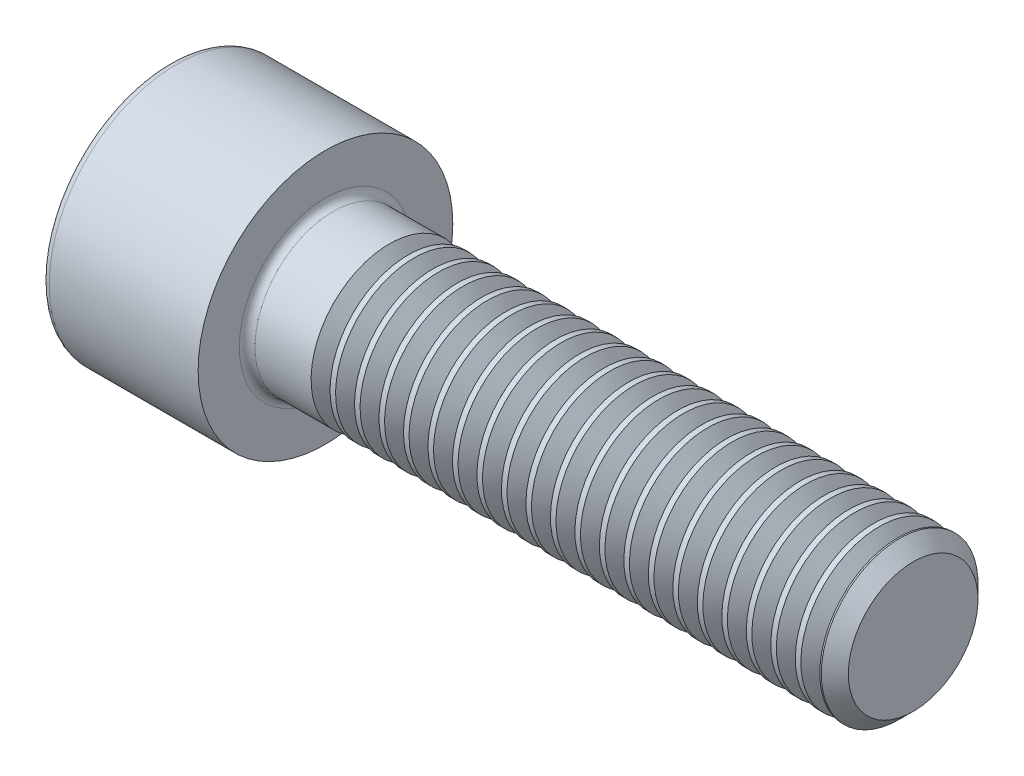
ISO-10303-21;
HEADER;
FILE_DESCRIPTION(('STEP AP214'),'2;1');
FILE_NAME('part.step','',(''),(''),'','','');
FILE_SCHEMA(('AUTOMOTIVE_DESIGN { 1 0 10303 214 1 1 1 1 }'));
ENDSEC;
DATA;
#1=APPLICATION_CONTEXT('core data for automotive mechanical design processes');
#2=APPLICATION_PROTOCOL_DEFINITION('international standard','automotive_design',2000,#1);
#3=PRODUCT_CONTEXT('',#1,'mechanical');
#4=PRODUCT('Part','Part','',(#3));
#5=PRODUCT_RELATED_PRODUCT_CATEGORY('part','',(#4));
#6=PRODUCT_DEFINITION_FORMATION('','',#4);
#7=PRODUCT_DEFINITION_CONTEXT('part definition',#1,'design');
#8=PRODUCT_DEFINITION('design','',#6,#7);
#9=PRODUCT_DEFINITION_SHAPE('','',#8);
#10=(LENGTH_UNIT() NAMED_UNIT(*) SI_UNIT(.MILLI.,.METRE.));
#11=(NAMED_UNIT(*) PLANE_ANGLE_UNIT() SI_UNIT($,.RADIAN.));
#12=(NAMED_UNIT(*) SI_UNIT($,.STERADIAN.) SOLID_ANGLE_UNIT());
#13=UNCERTAINTY_MEASURE_WITH_UNIT(LENGTH_MEASURE(1.E-05),#10,'distance_accuracy_value','');
#14=(GEOMETRIC_REPRESENTATION_CONTEXT(3) GLOBAL_UNCERTAINTY_ASSIGNED_CONTEXT((#13)) GLOBAL_UNIT_ASSIGNED_CONTEXT((#10,
#11,#12)) REPRESENTATION_CONTEXT('',''));
#15=CARTESIAN_POINT('',(0.,0.,0.));
#16=DIRECTION('',(0.,0.,1.));
#17=DIRECTION('',(1.,0.,0.));
#18=AXIS2_PLACEMENT_3D('',#15,#16,#17);
#19=CARTESIAN_POINT('',(0.,0.,0.));
#20=DIRECTION('',(-1.,0.,0.));
#21=DIRECTION('',(0.,0.,1.));
#22=AXIS2_PLACEMENT_3D('',#19,#20,#21);
#23=PLANE('',#22);
#24=DIRECTION('',(0.,-0.499999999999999,0.866025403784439));
#25=VECTOR('',#24,1.);
#26=CARTESIAN_POINT('',(0.,3.51894989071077,0.));
#27=LINE('',#26,#25);
#28=CARTESIAN_POINT('',(0.,3.51894989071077,0.));
#29=VERTEX_POINT('',#28);
#30=CARTESIAN_POINT('',(0.,1.75947494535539,3.04749999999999));
#31=VERTEX_POINT('',#30);
#32=EDGE_CURVE('E111',#29,#31,#27,.T.);
#33=ORIENTED_EDGE('',*,*,#32,.T.);
#34=DIRECTION('',(0.,1.,0.));
#35=VECTOR('',#34,1.);
#36=CARTESIAN_POINT('',(0.,-1.75947494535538,3.0475));
#37=LINE('',#36,#35);
#38=CARTESIAN_POINT('',(0.,-1.75947494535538,3.0475));
#39=VERTEX_POINT('',#38);
#40=EDGE_CURVE('E100',#39,#31,#37,.T.);
#41=ORIENTED_EDGE('',*,*,#40,.F.);
#42=DIRECTION('',(0.,-0.500000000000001,-0.866025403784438));
#43=VECTOR('',#42,1.);
#44=CARTESIAN_POINT('',(0.,-1.75947494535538,3.0475));
#45=LINE('',#44,#43);
#46=CARTESIAN_POINT('',(0.,-3.51894989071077,0.));
#47=VERTEX_POINT('',#46);
#48=EDGE_CURVE('E110',#39,#47,#45,.T.);
#49=ORIENTED_EDGE('',*,*,#48,.T.);
#50=DIRECTION('',(0.,0.499999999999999,-0.866025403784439));
#51=VECTOR('',#50,1.);
#52=CARTESIAN_POINT('',(0.,-3.51894989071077,0.));
#53=LINE('',#52,#51);
#54=CARTESIAN_POINT('',(0.,-1.75947494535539,-3.0475));
#55=VERTEX_POINT('',#54);
#56=EDGE_CURVE('E134',#47,#55,#53,.T.);
#57=ORIENTED_EDGE('',*,*,#56,.T.);
#58=DIRECTION('',(0.,-1.,0.));
#59=VECTOR('',#58,1.);
#60=CARTESIAN_POINT('',(0.,1.75947494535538,-3.04750000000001));
#61=LINE('',#60,#59);
#62=CARTESIAN_POINT('',(0.,1.75947494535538,-3.04750000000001));
#63=VERTEX_POINT('',#62);
#64=EDGE_CURVE('E137',#63,#55,#61,.T.);
#65=ORIENTED_EDGE('',*,*,#64,.F.);
#66=DIRECTION('',(0.,-0.500000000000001,-0.866025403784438));
#67=VECTOR('',#66,1.);
#68=CARTESIAN_POINT('',(0.,3.51894989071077,0.));
#69=LINE('',#68,#67);
#70=EDGE_CURVE('E125',#29,#63,#69,.T.);
#71=ORIENTED_EDGE('',*,*,#70,.F.);
#72=EDGE_LOOP('',(#33,#41,#49,#57,#65,#71));
#73=FACE_BOUND('',#72,.T.);
#74=CARTESIAN_POINT('',(0.,0.,0.));
#75=DIRECTION('',(-1.,0.,0.));
#76=DIRECTION('',(0.,0.,1.));
#77=AXIS2_PLACEMENT_3D('',#74,#75,#76);
#78=CIRCLE('',#77,6.1);
#79=CARTESIAN_POINT('',(0.,0.,6.1));
#80=VERTEX_POINT('',#79);
#81=EDGE_CURVE('E36',#80,#80,#78,.T.);
#82=ORIENTED_EDGE('',*,*,#81,.T.);
#83=EDGE_LOOP('',(#82));
#84=FACE_BOUND('',#83,.T.);
#85=ADVANCED_FACE('F29',(#73,#84),#23,.T.);
#86=CARTESIAN_POINT('',(-31.75,0.,0.));
#87=DIRECTION('',(-1.,0.,0.));
#88=DIRECTION('',(0.,0.,1.));
#89=AXIS2_PLACEMENT_3D('',#86,#87,#88);
#90=CYLINDRICAL_SURFACE('',#89,6.5);
#91=CARTESIAN_POINT('',(0.399999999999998,0.,0.));
#92=DIRECTION('',(-1.,0.,0.));
#93=DIRECTION('',(0.,0.,1.));
#94=AXIS2_PLACEMENT_3D('',#91,#92,#93);
#95=CIRCLE('',#94,6.5);
#96=CARTESIAN_POINT('',(0.399999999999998,0.,6.5));
#97=VERTEX_POINT('',#96);
#98=EDGE_CURVE('E11',#97,#97,#95,.F.);
#99=ORIENTED_EDGE('',*,*,#98,.T.);
#100=EDGE_LOOP('',(#99));
#101=FACE_BOUND('',#100,.T.);
#102=CARTESIAN_POINT('',(8.00000000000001,0.,0.));
#103=DIRECTION('',(-1.,0.,0.));
#104=DIRECTION('',(0.,0.,1.));
#105=AXIS2_PLACEMENT_3D('',#102,#103,#104);
#106=CIRCLE('',#105,6.5);
#107=CARTESIAN_POINT('',(8.00000000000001,0.,6.5));
#108=VERTEX_POINT('',#107);
#109=EDGE_CURVE('E182',#108,#108,#106,.T.);
#110=ORIENTED_EDGE('',*,*,#109,.T.);
#111=EDGE_LOOP('',(#110));
#112=FACE_BOUND('',#111,.T.);
#113=ADVANCED_FACE('F210',(#101,#112),#90,.T.);
#114=CARTESIAN_POINT('',(8.,6.5,0.));
#115=DIRECTION('',(1.,0.,0.));
#116=DIRECTION('',(0.,0.,-1.));
#117=AXIS2_PLACEMENT_3D('',#114,#115,#116);
#118=PLANE('',#117);
#119=CARTESIAN_POINT('',(8.,0.,0.));
#120=DIRECTION('',(1.,0.,0.));
#121=DIRECTION('',(0.,0.,-1.));
#122=AXIS2_PLACEMENT_3D('',#119,#120,#121);
#123=CIRCLE('',#122,4.4);
#124=CARTESIAN_POINT('',(8.,0.,-4.4));
#125=VERTEX_POINT('',#124);
#126=EDGE_CURVE('E185',#125,#125,#123,.F.);
#127=ORIENTED_EDGE('',*,*,#126,.T.);
#128=EDGE_LOOP('',(#127));
#129=FACE_BOUND('',#128,.T.);
#130=ORIENTED_EDGE('',*,*,#109,.F.);
#131=EDGE_LOOP('',(#130));
#132=FACE_BOUND('',#131,.T.);
#133=ADVANCED_FACE('F213',(#129,#132),#118,.T.);
#134=CARTESIAN_POINT('',(-31.75,0.,0.));
#135=DIRECTION('',(-1.,0.,0.));
#136=DIRECTION('',(0.,0.,1.));
#137=AXIS2_PLACEMENT_3D('',#134,#135,#136);
#138=CYLINDRICAL_SURFACE('',#137,4.);
#139=CARTESIAN_POINT('',(11.2665066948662,0.,0.));
#140=DIRECTION('',(-1.,0.,0.));
#141=DIRECTION('',(0.,-1.,0.));
#142=AXIS2_PLACEMENT_3D('',#139,#140,#141);
#143=CIRCLE('',#142,4.);
#144=CARTESIAN_POINT('',(11.2665066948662,-4.,0.));
#145=VERTEX_POINT('',#144);
#146=EDGE_CURVE('E129',#145,#145,#143,.T.);
#147=ORIENTED_EDGE('',*,*,#146,.T.);
#148=EDGE_LOOP('',(#147));
#149=FACE_BOUND('',#148,.T.);
#150=CARTESIAN_POINT('',(8.4,0.,0.));
#151=DIRECTION('',(1.,0.,0.));
#152=DIRECTION('',(0.,0.,-1.));
#153=AXIS2_PLACEMENT_3D('',#150,#151,#152);
#154=CIRCLE('',#153,4.);
#155=CARTESIAN_POINT('',(8.4,0.,-4.));
#156=VERTEX_POINT('',#155);
#157=EDGE_CURVE('E188',#156,#156,#154,.T.);
#158=ORIENTED_EDGE('',*,*,#157,.T.);
#159=EDGE_LOOP('',(#158));
#160=FACE_BOUND('',#159,.T.);
#161=ADVANCED_FACE('F205',(#149,#160),#138,.T.);
#162=CARTESIAN_POINT('',(8.4,0.,0.));
#163=DIRECTION('',(1.,0.,0.));
#164=DIRECTION('',(0.,0.,-1.));
#165=AXIS2_PLACEMENT_3D('',#162,#163,#164);
#166=TOROIDAL_SURFACE('',#165,4.4,0.4);
#167=ORIENTED_EDGE('',*,*,#157,.F.);
#168=EDGE_LOOP('',(#167));
#169=FACE_BOUND('',#168,.T.);
#170=ORIENTED_EDGE('',*,*,#126,.F.);
#171=EDGE_LOOP('',(#170));
#172=FACE_BOUND('',#171,.T.);
#173=ADVANCED_FACE('F195',(#169,#172),#166,.F.);
#174=CARTESIAN_POINT('',(0.399999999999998,0.,0.));
#175=DIRECTION('',(-1.,0.,0.));
#176=DIRECTION('',(0.,0.,1.));
#177=AXIS2_PLACEMENT_3D('',#174,#175,#176);
#178=TOROIDAL_SURFACE('',#177,6.1,0.4);
#179=ORIENTED_EDGE('',*,*,#98,.F.);
#180=EDGE_LOOP('',(#179));
#181=FACE_BOUND('',#180,.T.);
#182=ORIENTED_EDGE('',*,*,#81,.F.);
#183=EDGE_LOOP('',(#182));
#184=FACE_BOUND('',#183,.T.);
#185=ADVANCED_FACE('F193',(#181,#184),#178,.T.);
#186=CARTESIAN_POINT('',(4.,3.51894989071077,0.));
#187=DIRECTION('',(0.,-0.866025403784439,-0.499999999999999));
#188=DIRECTION('',(0.,0.499999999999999,-0.866025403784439));
#189=AXIS2_PLACEMENT_3D('',#186,#187,#188);
#190=PLANE('',#189);
#191=ORIENTED_EDGE('',*,*,#32,.F.);
#192=DIRECTION('',(-1.,0.,0.));
#193=VECTOR('',#192,1.);
#194=CARTESIAN_POINT('',(4.,3.51894989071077,0.));
#195=LINE('',#194,#193);
#196=CARTESIAN_POINT('',(4.,3.51894989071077,0.));
#197=VERTEX_POINT('',#196);
#198=EDGE_CURVE('E160',#197,#29,#195,.T.);
#199=ORIENTED_EDGE('',*,*,#198,.F.);
#200=DIRECTION('',(0.,-0.499999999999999,0.866025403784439));
#201=VECTOR('',#200,1.);
#202=CARTESIAN_POINT('',(4.,3.51894989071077,0.));
#203=LINE('',#202,#201);
#204=CARTESIAN_POINT('',(4.,2.63921241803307,1.52374999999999));
#205=VERTEX_POINT('',#204);
#206=EDGE_CURVE('E140',#197,#205,#203,.T.);
#207=ORIENTED_EDGE('',*,*,#206,.T.);
#208=CARTESIAN_POINT('',(4.,1.75947494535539,3.04749999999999));
#209=VERTEX_POINT('',#208);
#210=EDGE_CURVE('E119',#205,#209,#203,.T.);
#211=ORIENTED_EDGE('',*,*,#210,.T.);
#212=DIRECTION('',(-1.,0.,0.));
#213=VECTOR('',#212,1.);
#214=CARTESIAN_POINT('',(4.,1.75947494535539,3.04749999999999));
#215=LINE('',#214,#213);
#216=EDGE_CURVE('E104',#209,#31,#215,.T.);
#217=ORIENTED_EDGE('',*,*,#216,.T.);
#218=EDGE_LOOP('',(#191,#199,#207,#211,#217));
#219=FACE_BOUND('',#218,.T.);
#220=ADVANCED_FACE('F115',(#219),#190,.T.);
#221=CARTESIAN_POINT('',(4.,-1.75947494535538,3.0475));
#222=DIRECTION('',(0.,0.,1.));
#223=DIRECTION('',(0.,-1.,0.));
#224=AXIS2_PLACEMENT_3D('',#221,#222,#223);
#225=PLANE('',#224);
#226=ORIENTED_EDGE('',*,*,#40,.T.);
#227=ORIENTED_EDGE('',*,*,#216,.F.);
#228=DIRECTION('',(0.,1.,0.));
#229=VECTOR('',#228,1.);
#230=CARTESIAN_POINT('',(4.,-1.75947494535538,3.0475));
#231=LINE('',#230,#229);
#232=CARTESIAN_POINT('',(4.,0.,3.0475));
#233=VERTEX_POINT('',#232);
#234=EDGE_CURVE('E142',#233,#209,#231,.T.);
#235=ORIENTED_EDGE('',*,*,#234,.F.);
#236=CARTESIAN_POINT('',(4.,-1.75947494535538,3.0475));
#237=VERTEX_POINT('',#236);
#238=EDGE_CURVE('E143',#237,#233,#231,.T.);
#239=ORIENTED_EDGE('',*,*,#238,.F.);
#240=DIRECTION('',(-1.,0.,0.));
#241=VECTOR('',#240,1.);
#242=CARTESIAN_POINT('',(4.,-1.75947494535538,3.0475));
#243=LINE('',#242,#241);
#244=EDGE_CURVE('E106',#237,#39,#243,.T.);
#245=ORIENTED_EDGE('',*,*,#244,.T.);
#246=EDGE_LOOP('',(#226,#227,#235,#239,#245));
#247=FACE_BOUND('',#246,.T.);
#248=ADVANCED_FACE('F102',(#247),#225,.F.);
#249=CARTESIAN_POINT('',(4.,-1.75947494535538,3.0475));
#250=DIRECTION('',(0.,0.866025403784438,-0.500000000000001));
#251=DIRECTION('',(0.,0.500000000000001,0.866025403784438));
#252=AXIS2_PLACEMENT_3D('',#249,#250,#251);
#253=PLANE('',#252);
#254=ORIENTED_EDGE('',*,*,#48,.F.);
#255=ORIENTED_EDGE('',*,*,#244,.F.);
#256=DIRECTION('',(0.,-0.500000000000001,-0.866025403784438));
#257=VECTOR('',#256,1.);
#258=CARTESIAN_POINT('',(4.,-1.75947494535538,3.0475));
#259=LINE('',#258,#257);
#260=CARTESIAN_POINT('',(4.,-2.63921241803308,1.52375));
#261=VERTEX_POINT('',#260);
#262=EDGE_CURVE('E147',#237,#261,#259,.T.);
#263=ORIENTED_EDGE('',*,*,#262,.T.);
#264=CARTESIAN_POINT('',(4.,-3.51894989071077,0.));
#265=VERTEX_POINT('',#264);
#266=EDGE_CURVE('E146',#261,#265,#259,.T.);
#267=ORIENTED_EDGE('',*,*,#266,.T.);
#268=DIRECTION('',(-1.,0.,0.));
#269=VECTOR('',#268,1.);
#270=CARTESIAN_POINT('',(4.,-3.51894989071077,0.));
#271=LINE('',#270,#269);
#272=EDGE_CURVE('E168',#265,#47,#271,.T.);
#273=ORIENTED_EDGE('',*,*,#272,.T.);
#274=EDGE_LOOP('',(#254,#255,#263,#267,#273));
#275=FACE_BOUND('',#274,.T.);
#276=ADVANCED_FACE('F449',(#275),#253,.T.);
#277=CARTESIAN_POINT('',(4.,-3.51894989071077,0.));
#278=DIRECTION('',(0.,0.866025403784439,0.499999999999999));
#279=DIRECTION('',(0.,-0.499999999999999,0.866025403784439));
#280=AXIS2_PLACEMENT_3D('',#277,#278,#279);
#281=PLANE('',#280);
#282=ORIENTED_EDGE('',*,*,#56,.F.);
#283=ORIENTED_EDGE('',*,*,#272,.F.);
#284=DIRECTION('',(0.,0.499999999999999,-0.866025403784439));
#285=VECTOR('',#284,1.);
#286=CARTESIAN_POINT('',(4.,-3.51894989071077,0.));
#287=LINE('',#286,#285);
#288=CARTESIAN_POINT('',(4.,-2.63921241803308,-1.52375));
#289=VERTEX_POINT('',#288);
#290=EDGE_CURVE('E151',#265,#289,#287,.T.);
#291=ORIENTED_EDGE('',*,*,#290,.T.);
#292=CARTESIAN_POINT('',(4.,-1.75947494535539,-3.0475));
#293=VERTEX_POINT('',#292);
#294=EDGE_CURVE('E150',#289,#293,#287,.T.);
#295=ORIENTED_EDGE('',*,*,#294,.T.);
#296=DIRECTION('',(-1.,0.,0.));
#297=VECTOR('',#296,1.);
#298=CARTESIAN_POINT('',(4.,-1.75947494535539,-3.0475));
#299=LINE('',#298,#297);
#300=EDGE_CURVE('E165',#293,#55,#299,.T.);
#301=ORIENTED_EDGE('',*,*,#300,.T.);
#302=EDGE_LOOP('',(#282,#283,#291,#295,#301));
#303=FACE_BOUND('',#302,.T.);
#304=ADVANCED_FACE('F445',(#303),#281,.T.);
#305=CARTESIAN_POINT('',(4.,1.75947494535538,-3.04750000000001));
#306=DIRECTION('',(0.,0.,-1.));
#307=DIRECTION('',(0.,1.,0.));
#308=AXIS2_PLACEMENT_3D('',#305,#306,#307);
#309=PLANE('',#308);
#310=ORIENTED_EDGE('',*,*,#64,.T.);
#311=ORIENTED_EDGE('',*,*,#300,.F.);
#312=DIRECTION('',(0.,-1.,0.));
#313=VECTOR('',#312,1.);
#314=CARTESIAN_POINT('',(4.,1.75947494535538,-3.04750000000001));
#315=LINE('',#314,#313);
#316=CARTESIAN_POINT('',(4.,0.,-3.0475));
#317=VERTEX_POINT('',#316);
#318=EDGE_CURVE('E154',#317,#293,#315,.T.);
#319=ORIENTED_EDGE('',*,*,#318,.F.);
#320=CARTESIAN_POINT('',(4.,1.75947494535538,-3.04750000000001));
#321=VERTEX_POINT('',#320);
#322=EDGE_CURVE('E43',#321,#317,#315,.T.);
#323=ORIENTED_EDGE('',*,*,#322,.F.);
#324=DIRECTION('',(-1.,0.,0.));
#325=VECTOR('',#324,1.);
#326=CARTESIAN_POINT('',(4.,1.75947494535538,-3.04750000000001));
#327=LINE('',#326,#325);
#328=EDGE_CURVE('E162',#321,#63,#327,.T.);
#329=ORIENTED_EDGE('',*,*,#328,.T.);
#330=EDGE_LOOP('',(#310,#311,#319,#323,#329));
#331=FACE_BOUND('',#330,.T.);
#332=ADVANCED_FACE('F441',(#331),#309,.F.);
#333=CARTESIAN_POINT('',(4.,3.51894989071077,0.));
#334=DIRECTION('',(0.,0.866025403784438,-0.500000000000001));
#335=DIRECTION('',(0.,0.500000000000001,0.866025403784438));
#336=AXIS2_PLACEMENT_3D('',#333,#334,#335);
#337=PLANE('',#336);
#338=ORIENTED_EDGE('',*,*,#70,.T.);
#339=ORIENTED_EDGE('',*,*,#328,.F.);
#340=DIRECTION('',(0.,-0.500000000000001,-0.866025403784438));
#341=VECTOR('',#340,1.);
#342=CARTESIAN_POINT('',(4.,3.51894989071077,0.));
#343=LINE('',#342,#341);
#344=CARTESIAN_POINT('',(4.,2.63921241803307,-1.52375));
#345=VERTEX_POINT('',#344);
#346=EDGE_CURVE('E156',#345,#321,#343,.T.);
#347=ORIENTED_EDGE('',*,*,#346,.F.);
#348=EDGE_CURVE('E157',#197,#345,#343,.T.);
#349=ORIENTED_EDGE('',*,*,#348,.F.);
#350=ORIENTED_EDGE('',*,*,#198,.T.);
#351=EDGE_LOOP('',(#338,#339,#347,#349,#350));
#352=FACE_BOUND('',#351,.T.);
#353=ADVANCED_FACE('F436',(#352),#337,.F.);
#354=CARTESIAN_POINT('',(4.,5.27842483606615,-3.04750000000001));
#355=DIRECTION('',(1.,0.,0.));
#356=DIRECTION('',(0.,0.,-1.));
#357=AXIS2_PLACEMENT_3D('',#354,#355,#356);
#358=PLANE('',#357);
#359=ORIENTED_EDGE('',*,*,#318,.T.);
#360=ORIENTED_EDGE('',*,*,#294,.F.);
#361=CARTESIAN_POINT('',(4.,0.,0.));
#362=DIRECTION('',(-1.,0.,0.));
#363=DIRECTION('',(0.,0.,1.));
#364=AXIS2_PLACEMENT_3D('',#361,#362,#363);
#365=CIRCLE('',#364,3.0475);
#366=EDGE_CURVE('E475',#317,#289,#365,.T.);
#367=ORIENTED_EDGE('',*,*,#366,.F.);
#368=EDGE_LOOP('',(#359,#360,#367));
#369=FACE_BOUND('',#368,.T.);
#370=ADVANCED_FACE('F432',(#369),#358,.F.);
#371=ORIENTED_EDGE('',*,*,#290,.F.);
#372=ORIENTED_EDGE('',*,*,#266,.F.);
#373=EDGE_CURVE('E473',#289,#261,#365,.T.);
#374=ORIENTED_EDGE('',*,*,#373,.F.);
#375=EDGE_LOOP('',(#371,#372,#374));
#376=FACE_BOUND('',#375,.T.);
#377=ADVANCED_FACE('F435',(#376),#358,.F.);
#378=ORIENTED_EDGE('',*,*,#262,.F.);
#379=ORIENTED_EDGE('',*,*,#238,.T.);
#380=EDGE_CURVE('E120',#261,#233,#365,.T.);
#381=ORIENTED_EDGE('',*,*,#380,.F.);
#382=EDGE_LOOP('',(#378,#379,#381));
#383=FACE_BOUND('',#382,.T.);
#384=ADVANCED_FACE('F469',(#383),#358,.F.);
#385=ORIENTED_EDGE('',*,*,#234,.T.);
#386=ORIENTED_EDGE('',*,*,#210,.F.);
#387=EDGE_CURVE('E172',#233,#205,#365,.T.);
#388=ORIENTED_EDGE('',*,*,#387,.F.);
#389=EDGE_LOOP('',(#385,#386,#388));
#390=FACE_BOUND('',#389,.T.);
#391=ADVANCED_FACE('F466',(#390),#358,.F.);
#392=ORIENTED_EDGE('',*,*,#206,.F.);
#393=ORIENTED_EDGE('',*,*,#348,.T.);
#394=EDGE_CURVE('E176',#205,#345,#365,.T.);
#395=ORIENTED_EDGE('',*,*,#394,.F.);
#396=EDGE_LOOP('',(#392,#393,#395));
#397=FACE_BOUND('',#396,.T.);
#398=ADVANCED_FACE('F459',(#397),#358,.F.);
#399=ORIENTED_EDGE('',*,*,#346,.T.);
#400=ORIENTED_EDGE('',*,*,#322,.T.);
#401=EDGE_CURVE('E479',#345,#317,#365,.T.);
#402=ORIENTED_EDGE('',*,*,#401,.F.);
#403=EDGE_LOOP('',(#399,#400,#402));
#404=FACE_BOUND('',#403,.T.);
#405=ADVANCED_FACE('F438',(#404),#358,.F.);
#406=CARTESIAN_POINT('',(4.,0.,0.));
#407=DIRECTION('',(-1.,0.,0.));
#408=DIRECTION('',(0.,0.,1.));
#409=AXIS2_PLACEMENT_3D('',#406,#407,#408);
#410=CONICAL_SURFACE('',#409,3.0475,1.04719755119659);
#411=CARTESIAN_POINT('',(5.75947494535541,0.,0.));
#412=VERTEX_POINT('',#411);
#413=VERTEX_LOOP('',#412);
#414=FACE_BOUND('',#413,.T.);
#415=ORIENTED_EDGE('',*,*,#387,.T.);
#416=ORIENTED_EDGE('',*,*,#394,.T.);
#417=ORIENTED_EDGE('',*,*,#401,.T.);
#418=ORIENTED_EDGE('',*,*,#366,.T.);
#419=ORIENTED_EDGE('',*,*,#373,.T.);
#420=ORIENTED_EDGE('',*,*,#380,.T.);
#421=EDGE_LOOP('',(#415,#416,#417,#418,#419,#420));
#422=FACE_BOUND('',#421,.T.);
#423=ADVANCED_FACE('F430',(#414,#422),#410,.F.);
#424=CARTESIAN_POINT('',(12.2334933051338,0.,0.));
#425=DIRECTION('',(1.,0.,0.));
#426=DIRECTION('',(0.,1.,0.));
#427=AXIS2_PLACEMENT_3D('',#424,#425,#426);
#428=CONICAL_SURFACE('',#427,4.,0.959931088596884);
#429=CARTESIAN_POINT('',(11.75,0.,0.));
#430=DIRECTION('',(-1.,0.,0.));
#431=DIRECTION('',(0.,-1.,0.));
#432=AXIS2_PLACEMENT_3D('',#429,#430,#431);
#433=CIRCLE('',#432,3.3095);
#434=CARTESIAN_POINT('',(11.75,-3.3095,0.));
#435=VERTEX_POINT('',#434);
#436=EDGE_CURVE('E980',#435,#435,#433,.T.);
#437=ORIENTED_EDGE('',*,*,#436,.F.);
#438=EDGE_LOOP('',(#437));
#439=FACE_BOUND('',#438,.T.);
#440=CARTESIAN_POINT('',(12.2334933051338,0.,0.));
#441=DIRECTION('',(-1.,0.,0.));
#442=DIRECTION('',(0.,-1.,0.));
#443=AXIS2_PLACEMENT_3D('',#440,#441,#442);
#444=CIRCLE('',#443,4.);
#445=CARTESIAN_POINT('',(12.2334933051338,-4.,0.));
#446=VERTEX_POINT('',#445);
#447=EDGE_CURVE('E126',#446,#446,#444,.T.);
#448=ORIENTED_EDGE('',*,*,#447,.T.);
#449=EDGE_LOOP('',(#448));
#450=FACE_BOUND('',#449,.T.);
#451=ADVANCED_FACE('F426',(#439,#450),#428,.T.);
#452=CARTESIAN_POINT('',(11.75,0.,0.));
#453=DIRECTION('',(-1.,0.,0.));
#454=DIRECTION('',(0.,-1.,0.));
#455=AXIS2_PLACEMENT_3D('',#452,#453,#454);
#456=CONICAL_SURFACE('',#455,3.3095,0.959931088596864);
#457=ORIENTED_EDGE('',*,*,#146,.F.);
#458=EDGE_LOOP('',(#457));
#459=FACE_BOUND('',#458,.T.);
#460=ORIENTED_EDGE('',*,*,#436,.T.);
#461=EDGE_LOOP('',(#460));
#462=FACE_BOUND('',#461,.T.);
#463=ADVANCED_FACE('F423',(#459,#462),#456,.T.);
#464=CARTESIAN_POINT('',(12.5165066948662,0.,0.));
#465=DIRECTION('',(-1.,0.,0.));
#466=DIRECTION('',(0.,-1.,0.));
#467=AXIS2_PLACEMENT_3D('',#464,#465,#466);
#468=CIRCLE('',#467,4.);
#469=CARTESIAN_POINT('',(12.5165066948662,-4.,0.));
#470=VERTEX_POINT('',#469);
#471=EDGE_CURVE('E974',#470,#470,#468,.T.);
#472=ORIENTED_EDGE('',*,*,#471,.T.);
#473=EDGE_LOOP('',(#472));
#474=FACE_BOUND('',#473,.T.);
#475=ORIENTED_EDGE('',*,*,#447,.F.);
#476=EDGE_LOOP('',(#475));
#477=FACE_BOUND('',#476,.T.);
#478=ADVANCED_FACE('F226',(#474,#477),#138,.T.);
#479=CARTESIAN_POINT('',(13.4834933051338,0.,0.));
#480=DIRECTION('',(1.,0.,0.));
#481=DIRECTION('',(0.,1.,0.));
#482=AXIS2_PLACEMENT_3D('',#479,#480,#481);
#483=CONICAL_SURFACE('',#482,4.,0.959931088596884);
#484=CARTESIAN_POINT('',(13.,0.,0.));
#485=DIRECTION('',(-1.,0.,0.));
#486=DIRECTION('',(0.,-1.,0.));
#487=AXIS2_PLACEMENT_3D('',#484,#485,#486);
#488=CIRCLE('',#487,3.3095);
#489=CARTESIAN_POINT('',(13.,-3.3095,0.));
#490=VERTEX_POINT('',#489);
#491=EDGE_CURVE('E971',#490,#490,#488,.T.);
#492=ORIENTED_EDGE('',*,*,#491,.F.);
#493=EDGE_LOOP('',(#492));
#494=FACE_BOUND('',#493,.T.);
#495=CARTESIAN_POINT('',(13.4834933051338,0.,0.));
#496=DIRECTION('',(-1.,0.,0.));
#497=DIRECTION('',(0.,-1.,0.));
#498=AXIS2_PLACEMENT_3D('',#495,#496,#497);
#499=CIRCLE('',#498,4.);
#500=CARTESIAN_POINT('',(13.4834933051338,-4.,0.));
#501=VERTEX_POINT('',#500);
#502=EDGE_CURVE('E977',#501,#501,#499,.T.);
#503=ORIENTED_EDGE('',*,*,#502,.T.);
#504=EDGE_LOOP('',(#503));
#505=FACE_BOUND('',#504,.T.);
#506=ADVANCED_FACE('F418',(#494,#505),#483,.T.);
#507=CARTESIAN_POINT('',(13.,0.,0.));
#508=DIRECTION('',(-1.,0.,0.));
#509=DIRECTION('',(0.,-1.,0.));
#510=AXIS2_PLACEMENT_3D('',#507,#508,#509);
#511=CONICAL_SURFACE('',#510,3.3095,0.959931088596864);
#512=ORIENTED_EDGE('',*,*,#471,.F.);
#513=EDGE_LOOP('',(#512));
#514=FACE_BOUND('',#513,.T.);
#515=ORIENTED_EDGE('',*,*,#491,.T.);
#516=EDGE_LOOP('',(#515));
#517=FACE_BOUND('',#516,.T.);
#518=ADVANCED_FACE('F415',(#514,#517),#511,.T.);
#519=CARTESIAN_POINT('',(13.7665066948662,0.,0.));
#520=DIRECTION('',(-1.,0.,0.));
#521=DIRECTION('',(0.,-1.,0.));
#522=AXIS2_PLACEMENT_3D('',#519,#520,#521);
#523=CIRCLE('',#522,4.);
#524=CARTESIAN_POINT('',(13.7665066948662,-4.,0.));
#525=VERTEX_POINT('',#524);
#526=EDGE_CURVE('E965',#525,#525,#523,.T.);
#527=ORIENTED_EDGE('',*,*,#526,.T.);
#528=EDGE_LOOP('',(#527));
#529=FACE_BOUND('',#528,.T.);
#530=ORIENTED_EDGE('',*,*,#502,.F.);
#531=EDGE_LOOP('',(#530));
#532=FACE_BOUND('',#531,.T.);
#533=ADVANCED_FACE('F413',(#529,#532),#138,.T.);
#534=CARTESIAN_POINT('',(14.7334933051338,0.,0.));
#535=DIRECTION('',(1.,0.,0.));
#536=DIRECTION('',(0.,1.,0.));
#537=AXIS2_PLACEMENT_3D('',#534,#535,#536);
#538=CONICAL_SURFACE('',#537,4.,0.959931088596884);
#539=CARTESIAN_POINT('',(14.25,0.,0.));
#540=DIRECTION('',(-1.,0.,0.));
#541=DIRECTION('',(0.,-1.,0.));
#542=AXIS2_PLACEMENT_3D('',#539,#540,#541);
#543=CIRCLE('',#542,3.3095);
#544=CARTESIAN_POINT('',(14.25,-3.3095,0.));
#545=VERTEX_POINT('',#544);
#546=EDGE_CURVE('E962',#545,#545,#543,.T.);
#547=ORIENTED_EDGE('',*,*,#546,.F.);
#548=EDGE_LOOP('',(#547));
#549=FACE_BOUND('',#548,.T.);
#550=CARTESIAN_POINT('',(14.7334933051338,0.,0.));
#551=DIRECTION('',(-1.,0.,0.));
#552=DIRECTION('',(0.,-1.,0.));
#553=AXIS2_PLACEMENT_3D('',#550,#551,#552);
#554=CIRCLE('',#553,4.);
#555=CARTESIAN_POINT('',(14.7334933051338,-4.,0.));
#556=VERTEX_POINT('',#555);
#557=EDGE_CURVE('E968',#556,#556,#554,.T.);
#558=ORIENTED_EDGE('',*,*,#557,.T.);
#559=EDGE_LOOP('',(#558));
#560=FACE_BOUND('',#559,.T.);
#561=ADVANCED_FACE('F409',(#549,#560),#538,.T.);
#562=CARTESIAN_POINT('',(14.25,0.,0.));
#563=DIRECTION('',(-1.,0.,0.));
#564=DIRECTION('',(0.,-1.,0.));
#565=AXIS2_PLACEMENT_3D('',#562,#563,#564);
#566=CONICAL_SURFACE('',#565,3.3095,0.959931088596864);
#567=ORIENTED_EDGE('',*,*,#526,.F.);
#568=EDGE_LOOP('',(#567));
#569=FACE_BOUND('',#568,.T.);
#570=ORIENTED_EDGE('',*,*,#546,.T.);
#571=EDGE_LOOP('',(#570));
#572=FACE_BOUND('',#571,.T.);
#573=ADVANCED_FACE('F406',(#569,#572),#566,.T.);
#574=CARTESIAN_POINT('',(15.0165066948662,0.,0.));
#575=DIRECTION('',(-1.,0.,0.));
#576=DIRECTION('',(0.,-1.,0.));
#577=AXIS2_PLACEMENT_3D('',#574,#575,#576);
#578=CIRCLE('',#577,4.);
#579=CARTESIAN_POINT('',(15.0165066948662,-4.,0.));
#580=VERTEX_POINT('',#579);
#581=EDGE_CURVE('E956',#580,#580,#578,.T.);
#582=ORIENTED_EDGE('',*,*,#581,.T.);
#583=EDGE_LOOP('',(#582));
#584=FACE_BOUND('',#583,.T.);
#585=ORIENTED_EDGE('',*,*,#557,.F.);
#586=EDGE_LOOP('',(#585));
#587=FACE_BOUND('',#586,.T.);
#588=ADVANCED_FACE('F404',(#584,#587),#138,.T.);
#589=CARTESIAN_POINT('',(15.9834933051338,0.,0.));
#590=DIRECTION('',(1.,0.,0.));
#591=DIRECTION('',(0.,1.,0.));
#592=AXIS2_PLACEMENT_3D('',#589,#590,#591);
#593=CONICAL_SURFACE('',#592,4.,0.959931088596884);
#594=CARTESIAN_POINT('',(15.5,0.,0.));
#595=DIRECTION('',(-1.,0.,0.));
#596=DIRECTION('',(0.,-1.,0.));
#597=AXIS2_PLACEMENT_3D('',#594,#595,#596);
#598=CIRCLE('',#597,3.3095);
#599=CARTESIAN_POINT('',(15.5,-3.3095,0.));
#600=VERTEX_POINT('',#599);
#601=EDGE_CURVE('E953',#600,#600,#598,.T.);
#602=ORIENTED_EDGE('',*,*,#601,.F.);
#603=EDGE_LOOP('',(#602));
#604=FACE_BOUND('',#603,.T.);
#605=CARTESIAN_POINT('',(15.9834933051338,0.,0.));
#606=DIRECTION('',(-1.,0.,0.));
#607=DIRECTION('',(0.,-1.,0.));
#608=AXIS2_PLACEMENT_3D('',#605,#606,#607);
#609=CIRCLE('',#608,4.);
#610=CARTESIAN_POINT('',(15.9834933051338,-4.,0.));
#611=VERTEX_POINT('',#610);
#612=EDGE_CURVE('E959',#611,#611,#609,.T.);
#613=ORIENTED_EDGE('',*,*,#612,.T.);
#614=EDGE_LOOP('',(#613));
#615=FACE_BOUND('',#614,.T.);
#616=ADVANCED_FACE('F400',(#604,#615),#593,.T.);
#617=CARTESIAN_POINT('',(15.5,0.,0.));
#618=DIRECTION('',(-1.,0.,0.));
#619=DIRECTION('',(0.,-1.,0.));
#620=AXIS2_PLACEMENT_3D('',#617,#618,#619);
#621=CONICAL_SURFACE('',#620,3.3095,0.959931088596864);
#622=ORIENTED_EDGE('',*,*,#581,.F.);
#623=EDGE_LOOP('',(#622));
#624=FACE_BOUND('',#623,.T.);
#625=ORIENTED_EDGE('',*,*,#601,.T.);
#626=EDGE_LOOP('',(#625));
#627=FACE_BOUND('',#626,.T.);
#628=ADVANCED_FACE('F397',(#624,#627),#621,.T.);
#629=CARTESIAN_POINT('',(16.2665066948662,0.,0.));
#630=DIRECTION('',(-1.,0.,0.));
#631=DIRECTION('',(0.,-1.,0.));
#632=AXIS2_PLACEMENT_3D('',#629,#630,#631);
#633=CIRCLE('',#632,4.);
#634=CARTESIAN_POINT('',(16.2665066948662,-4.,0.));
#635=VERTEX_POINT('',#634);
#636=EDGE_CURVE('E947',#635,#635,#633,.T.);
#637=ORIENTED_EDGE('',*,*,#636,.T.);
#638=EDGE_LOOP('',(#637));
#639=FACE_BOUND('',#638,.T.);
#640=ORIENTED_EDGE('',*,*,#612,.F.);
#641=EDGE_LOOP('',(#640));
#642=FACE_BOUND('',#641,.T.);
#643=ADVANCED_FACE('F395',(#639,#642),#138,.T.);
#644=CARTESIAN_POINT('',(17.2334933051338,0.,0.));
#645=DIRECTION('',(1.,0.,0.));
#646=DIRECTION('',(0.,1.,0.));
#647=AXIS2_PLACEMENT_3D('',#644,#645,#646);
#648=CONICAL_SURFACE('',#647,4.,0.959931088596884);
#649=CARTESIAN_POINT('',(16.75,0.,0.));
#650=DIRECTION('',(-1.,0.,0.));
#651=DIRECTION('',(0.,-1.,0.));
#652=AXIS2_PLACEMENT_3D('',#649,#650,#651);
#653=CIRCLE('',#652,3.3095);
#654=CARTESIAN_POINT('',(16.75,-3.3095,0.));
#655=VERTEX_POINT('',#654);
#656=EDGE_CURVE('E944',#655,#655,#653,.T.);
#657=ORIENTED_EDGE('',*,*,#656,.F.);
#658=EDGE_LOOP('',(#657));
#659=FACE_BOUND('',#658,.T.);
#660=CARTESIAN_POINT('',(17.2334933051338,0.,0.));
#661=DIRECTION('',(-1.,0.,0.));
#662=DIRECTION('',(0.,-1.,0.));
#663=AXIS2_PLACEMENT_3D('',#660,#661,#662);
#664=CIRCLE('',#663,4.);
#665=CARTESIAN_POINT('',(17.2334933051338,-4.,0.));
#666=VERTEX_POINT('',#665);
#667=EDGE_CURVE('E950',#666,#666,#664,.T.);
#668=ORIENTED_EDGE('',*,*,#667,.T.);
#669=EDGE_LOOP('',(#668));
#670=FACE_BOUND('',#669,.T.);
#671=ADVANCED_FACE('F391',(#659,#670),#648,.T.);
#672=CARTESIAN_POINT('',(16.75,0.,0.));
#673=DIRECTION('',(-1.,0.,0.));
#674=DIRECTION('',(0.,-1.,0.));
#675=AXIS2_PLACEMENT_3D('',#672,#673,#674);
#676=CONICAL_SURFACE('',#675,3.3095,0.959931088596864);
#677=ORIENTED_EDGE('',*,*,#636,.F.);
#678=EDGE_LOOP('',(#677));
#679=FACE_BOUND('',#678,.T.);
#680=ORIENTED_EDGE('',*,*,#656,.T.);
#681=EDGE_LOOP('',(#680));
#682=FACE_BOUND('',#681,.T.);
#683=ADVANCED_FACE('F388',(#679,#682),#676,.T.);
#684=CARTESIAN_POINT('',(17.5165066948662,0.,0.));
#685=DIRECTION('',(-1.,0.,0.));
#686=DIRECTION('',(0.,-1.,0.));
#687=AXIS2_PLACEMENT_3D('',#684,#685,#686);
#688=CIRCLE('',#687,4.);
#689=CARTESIAN_POINT('',(17.5165066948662,-4.,0.));
#690=VERTEX_POINT('',#689);
#691=EDGE_CURVE('E938',#690,#690,#688,.T.);
#692=ORIENTED_EDGE('',*,*,#691,.T.);
#693=EDGE_LOOP('',(#692));
#694=FACE_BOUND('',#693,.T.);
#695=ORIENTED_EDGE('',*,*,#667,.F.);
#696=EDGE_LOOP('',(#695));
#697=FACE_BOUND('',#696,.T.);
#698=ADVANCED_FACE('F386',(#694,#697),#138,.T.);
#699=CARTESIAN_POINT('',(18.4834933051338,0.,0.));
#700=DIRECTION('',(1.,0.,0.));
#701=DIRECTION('',(0.,1.,0.));
#702=AXIS2_PLACEMENT_3D('',#699,#700,#701);
#703=CONICAL_SURFACE('',#702,4.,0.959931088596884);
#704=CARTESIAN_POINT('',(18.,0.,0.));
#705=DIRECTION('',(-1.,0.,0.));
#706=DIRECTION('',(0.,-1.,0.));
#707=AXIS2_PLACEMENT_3D('',#704,#705,#706);
#708=CIRCLE('',#707,3.3095);
#709=CARTESIAN_POINT('',(18.,-3.3095,0.));
#710=VERTEX_POINT('',#709);
#711=EDGE_CURVE('E935',#710,#710,#708,.T.);
#712=ORIENTED_EDGE('',*,*,#711,.F.);
#713=EDGE_LOOP('',(#712));
#714=FACE_BOUND('',#713,.T.);
#715=CARTESIAN_POINT('',(18.4834933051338,0.,0.));
#716=DIRECTION('',(-1.,0.,0.));
#717=DIRECTION('',(0.,-1.,0.));
#718=AXIS2_PLACEMENT_3D('',#715,#716,#717);
#719=CIRCLE('',#718,4.);
#720=CARTESIAN_POINT('',(18.4834933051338,-4.,0.));
#721=VERTEX_POINT('',#720);
#722=EDGE_CURVE('E941',#721,#721,#719,.T.);
#723=ORIENTED_EDGE('',*,*,#722,.T.);
#724=EDGE_LOOP('',(#723));
#725=FACE_BOUND('',#724,.T.);
#726=ADVANCED_FACE('F382',(#714,#725),#703,.T.);
#727=CARTESIAN_POINT('',(18.,0.,0.));
#728=DIRECTION('',(-1.,0.,0.));
#729=DIRECTION('',(0.,-1.,0.));
#730=AXIS2_PLACEMENT_3D('',#727,#728,#729);
#731=CONICAL_SURFACE('',#730,3.3095,0.959931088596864);
#732=ORIENTED_EDGE('',*,*,#691,.F.);
#733=EDGE_LOOP('',(#732));
#734=FACE_BOUND('',#733,.T.);
#735=ORIENTED_EDGE('',*,*,#711,.T.);
#736=EDGE_LOOP('',(#735));
#737=FACE_BOUND('',#736,.T.);
#738=ADVANCED_FACE('F379',(#734,#737),#731,.T.);
#739=CARTESIAN_POINT('',(18.7665066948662,0.,0.));
#740=DIRECTION('',(-1.,0.,0.));
#741=DIRECTION('',(0.,-1.,0.));
#742=AXIS2_PLACEMENT_3D('',#739,#740,#741);
#743=CIRCLE('',#742,4.);
#744=CARTESIAN_POINT('',(18.7665066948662,-4.,0.));
#745=VERTEX_POINT('',#744);
#746=EDGE_CURVE('E929',#745,#745,#743,.T.);
#747=ORIENTED_EDGE('',*,*,#746,.T.);
#748=EDGE_LOOP('',(#747));
#749=FACE_BOUND('',#748,.T.);
#750=ORIENTED_EDGE('',*,*,#722,.F.);
#751=EDGE_LOOP('',(#750));
#752=FACE_BOUND('',#751,.T.);
#753=ADVANCED_FACE('F377',(#749,#752),#138,.T.);
#754=CARTESIAN_POINT('',(19.7334933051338,0.,0.));
#755=DIRECTION('',(1.,0.,0.));
#756=DIRECTION('',(0.,1.,0.));
#757=AXIS2_PLACEMENT_3D('',#754,#755,#756);
#758=CONICAL_SURFACE('',#757,4.,0.959931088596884);
#759=CARTESIAN_POINT('',(19.25,0.,0.));
#760=DIRECTION('',(-1.,0.,0.));
#761=DIRECTION('',(0.,-1.,0.));
#762=AXIS2_PLACEMENT_3D('',#759,#760,#761);
#763=CIRCLE('',#762,3.3095);
#764=CARTESIAN_POINT('',(19.25,-3.3095,0.));
#765=VERTEX_POINT('',#764);
#766=EDGE_CURVE('E926',#765,#765,#763,.T.);
#767=ORIENTED_EDGE('',*,*,#766,.F.);
#768=EDGE_LOOP('',(#767));
#769=FACE_BOUND('',#768,.T.);
#770=CARTESIAN_POINT('',(19.7334933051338,0.,0.));
#771=DIRECTION('',(-1.,0.,0.));
#772=DIRECTION('',(0.,-1.,0.));
#773=AXIS2_PLACEMENT_3D('',#770,#771,#772);
#774=CIRCLE('',#773,4.);
#775=CARTESIAN_POINT('',(19.7334933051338,-4.,0.));
#776=VERTEX_POINT('',#775);
#777=EDGE_CURVE('E932',#776,#776,#774,.T.);
#778=ORIENTED_EDGE('',*,*,#777,.T.);
#779=EDGE_LOOP('',(#778));
#780=FACE_BOUND('',#779,.T.);
#781=ADVANCED_FACE('F373',(#769,#780),#758,.T.);
#782=CARTESIAN_POINT('',(19.25,0.,0.));
#783=DIRECTION('',(-1.,0.,0.));
#784=DIRECTION('',(0.,-1.,0.));
#785=AXIS2_PLACEMENT_3D('',#782,#783,#784);
#786=CONICAL_SURFACE('',#785,3.3095,0.959931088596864);
#787=ORIENTED_EDGE('',*,*,#746,.F.);
#788=EDGE_LOOP('',(#787));
#789=FACE_BOUND('',#788,.T.);
#790=ORIENTED_EDGE('',*,*,#766,.T.);
#791=EDGE_LOOP('',(#790));
#792=FACE_BOUND('',#791,.T.);
#793=ADVANCED_FACE('F370',(#789,#792),#786,.T.);
#794=CARTESIAN_POINT('',(20.0165066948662,0.,0.));
#795=DIRECTION('',(-1.,0.,0.));
#796=DIRECTION('',(0.,-1.,0.));
#797=AXIS2_PLACEMENT_3D('',#794,#795,#796);
#798=CIRCLE('',#797,4.);
#799=CARTESIAN_POINT('',(20.0165066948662,-4.,0.));
#800=VERTEX_POINT('',#799);
#801=EDGE_CURVE('E920',#800,#800,#798,.T.);
#802=ORIENTED_EDGE('',*,*,#801,.T.);
#803=EDGE_LOOP('',(#802));
#804=FACE_BOUND('',#803,.T.);
#805=ORIENTED_EDGE('',*,*,#777,.F.);
#806=EDGE_LOOP('',(#805));
#807=FACE_BOUND('',#806,.T.);
#808=ADVANCED_FACE('F368',(#804,#807),#138,.T.);
#809=CARTESIAN_POINT('',(20.9834933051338,0.,0.));
#810=DIRECTION('',(1.,0.,0.));
#811=DIRECTION('',(0.,1.,0.));
#812=AXIS2_PLACEMENT_3D('',#809,#810,#811);
#813=CONICAL_SURFACE('',#812,4.,0.959931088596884);
#814=CARTESIAN_POINT('',(20.5,0.,0.));
#815=DIRECTION('',(-1.,0.,0.));
#816=DIRECTION('',(0.,-1.,0.));
#817=AXIS2_PLACEMENT_3D('',#814,#815,#816);
#818=CIRCLE('',#817,3.3095);
#819=CARTESIAN_POINT('',(20.5,-3.3095,0.));
#820=VERTEX_POINT('',#819);
#821=EDGE_CURVE('E917',#820,#820,#818,.T.);
#822=ORIENTED_EDGE('',*,*,#821,.F.);
#823=EDGE_LOOP('',(#822));
#824=FACE_BOUND('',#823,.T.);
#825=CARTESIAN_POINT('',(20.9834933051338,0.,0.));
#826=DIRECTION('',(-1.,0.,0.));
#827=DIRECTION('',(0.,-1.,0.));
#828=AXIS2_PLACEMENT_3D('',#825,#826,#827);
#829=CIRCLE('',#828,4.);
#830=CARTESIAN_POINT('',(20.9834933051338,-4.,0.));
#831=VERTEX_POINT('',#830);
#832=EDGE_CURVE('E923',#831,#831,#829,.T.);
#833=ORIENTED_EDGE('',*,*,#832,.T.);
#834=EDGE_LOOP('',(#833));
#835=FACE_BOUND('',#834,.T.);
#836=ADVANCED_FACE('F364',(#824,#835),#813,.T.);
#837=CARTESIAN_POINT('',(20.5,0.,0.));
#838=DIRECTION('',(-1.,0.,0.));
#839=DIRECTION('',(0.,-1.,0.));
#840=AXIS2_PLACEMENT_3D('',#837,#838,#839);
#841=CONICAL_SURFACE('',#840,3.3095,0.959931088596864);
#842=ORIENTED_EDGE('',*,*,#801,.F.);
#843=EDGE_LOOP('',(#842));
#844=FACE_BOUND('',#843,.T.);
#845=ORIENTED_EDGE('',*,*,#821,.T.);
#846=EDGE_LOOP('',(#845));
#847=FACE_BOUND('',#846,.T.);
#848=ADVANCED_FACE('F361',(#844,#847),#841,.T.);
#849=CARTESIAN_POINT('',(21.2665066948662,0.,0.));
#850=DIRECTION('',(-1.,0.,0.));
#851=DIRECTION('',(0.,-1.,0.));
#852=AXIS2_PLACEMENT_3D('',#849,#850,#851);
#853=CIRCLE('',#852,4.);
#854=CARTESIAN_POINT('',(21.2665066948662,-4.,0.));
#855=VERTEX_POINT('',#854);
#856=EDGE_CURVE('E911',#855,#855,#853,.T.);
#857=ORIENTED_EDGE('',*,*,#856,.T.);
#858=EDGE_LOOP('',(#857));
#859=FACE_BOUND('',#858,.T.);
#860=ORIENTED_EDGE('',*,*,#832,.F.);
#861=EDGE_LOOP('',(#860));
#862=FACE_BOUND('',#861,.T.);
#863=ADVANCED_FACE('F359',(#859,#862),#138,.T.);
#864=CARTESIAN_POINT('',(22.2334933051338,0.,0.));
#865=DIRECTION('',(1.,0.,0.));
#866=DIRECTION('',(0.,1.,0.));
#867=AXIS2_PLACEMENT_3D('',#864,#865,#866);
#868=CONICAL_SURFACE('',#867,4.,0.959931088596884);
#869=CARTESIAN_POINT('',(21.75,0.,0.));
#870=DIRECTION('',(-1.,0.,0.));
#871=DIRECTION('',(0.,-1.,0.));
#872=AXIS2_PLACEMENT_3D('',#869,#870,#871);
#873=CIRCLE('',#872,3.3095);
#874=CARTESIAN_POINT('',(21.75,-3.3095,0.));
#875=VERTEX_POINT('',#874);
#876=EDGE_CURVE('E908',#875,#875,#873,.T.);
#877=ORIENTED_EDGE('',*,*,#876,.F.);
#878=EDGE_LOOP('',(#877));
#879=FACE_BOUND('',#878,.T.);
#880=CARTESIAN_POINT('',(22.2334933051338,0.,0.));
#881=DIRECTION('',(-1.,0.,0.));
#882=DIRECTION('',(0.,-1.,0.));
#883=AXIS2_PLACEMENT_3D('',#880,#881,#882);
#884=CIRCLE('',#883,4.);
#885=CARTESIAN_POINT('',(22.2334933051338,-4.,0.));
#886=VERTEX_POINT('',#885);
#887=EDGE_CURVE('E914',#886,#886,#884,.T.);
#888=ORIENTED_EDGE('',*,*,#887,.T.);
#889=EDGE_LOOP('',(#888));
#890=FACE_BOUND('',#889,.T.);
#891=ADVANCED_FACE('F355',(#879,#890),#868,.T.);
#892=CARTESIAN_POINT('',(21.75,0.,0.));
#893=DIRECTION('',(-1.,0.,0.));
#894=DIRECTION('',(0.,-1.,0.));
#895=AXIS2_PLACEMENT_3D('',#892,#893,#894);
#896=CONICAL_SURFACE('',#895,3.3095,0.959931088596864);
#897=ORIENTED_EDGE('',*,*,#856,.F.);
#898=EDGE_LOOP('',(#897));
#899=FACE_BOUND('',#898,.T.);
#900=ORIENTED_EDGE('',*,*,#876,.T.);
#901=EDGE_LOOP('',(#900));
#902=FACE_BOUND('',#901,.T.);
#903=ADVANCED_FACE('F352',(#899,#902),#896,.T.);
#904=CARTESIAN_POINT('',(22.5165066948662,0.,0.));
#905=DIRECTION('',(-1.,0.,0.));
#906=DIRECTION('',(0.,-1.,0.));
#907=AXIS2_PLACEMENT_3D('',#904,#905,#906);
#908=CIRCLE('',#907,4.);
#909=CARTESIAN_POINT('',(22.5165066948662,-4.,0.));
#910=VERTEX_POINT('',#909);
#911=EDGE_CURVE('E902',#910,#910,#908,.T.);
#912=ORIENTED_EDGE('',*,*,#911,.T.);
#913=EDGE_LOOP('',(#912));
#914=FACE_BOUND('',#913,.T.);
#915=ORIENTED_EDGE('',*,*,#887,.F.);
#916=EDGE_LOOP('',(#915));
#917=FACE_BOUND('',#916,.T.);
#918=ADVANCED_FACE('F350',(#914,#917),#138,.T.);
#919=CARTESIAN_POINT('',(23.4834933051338,0.,0.));
#920=DIRECTION('',(1.,0.,0.));
#921=DIRECTION('',(0.,1.,0.));
#922=AXIS2_PLACEMENT_3D('',#919,#920,#921);
#923=CONICAL_SURFACE('',#922,4.,0.959931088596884);
#924=CARTESIAN_POINT('',(23.,0.,0.));
#925=DIRECTION('',(-1.,0.,0.));
#926=DIRECTION('',(0.,-1.,0.));
#927=AXIS2_PLACEMENT_3D('',#924,#925,#926);
#928=CIRCLE('',#927,3.3095);
#929=CARTESIAN_POINT('',(23.,-3.3095,0.));
#930=VERTEX_POINT('',#929);
#931=EDGE_CURVE('E899',#930,#930,#928,.T.);
#932=ORIENTED_EDGE('',*,*,#931,.F.);
#933=EDGE_LOOP('',(#932));
#934=FACE_BOUND('',#933,.T.);
#935=CARTESIAN_POINT('',(23.4834933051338,0.,0.));
#936=DIRECTION('',(-1.,0.,0.));
#937=DIRECTION('',(0.,-1.,0.));
#938=AXIS2_PLACEMENT_3D('',#935,#936,#937);
#939=CIRCLE('',#938,4.);
#940=CARTESIAN_POINT('',(23.4834933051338,-4.,0.));
#941=VERTEX_POINT('',#940);
#942=EDGE_CURVE('E905',#941,#941,#939,.T.);
#943=ORIENTED_EDGE('',*,*,#942,.T.);
#944=EDGE_LOOP('',(#943));
#945=FACE_BOUND('',#944,.T.);
#946=ADVANCED_FACE('F346',(#934,#945),#923,.T.);
#947=CARTESIAN_POINT('',(23.,0.,0.));
#948=DIRECTION('',(-1.,0.,0.));
#949=DIRECTION('',(0.,-1.,0.));
#950=AXIS2_PLACEMENT_3D('',#947,#948,#949);
#951=CONICAL_SURFACE('',#950,3.3095,0.959931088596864);
#952=ORIENTED_EDGE('',*,*,#911,.F.);
#953=EDGE_LOOP('',(#952));
#954=FACE_BOUND('',#953,.T.);
#955=ORIENTED_EDGE('',*,*,#931,.T.);
#956=EDGE_LOOP('',(#955));
#957=FACE_BOUND('',#956,.T.);
#958=ADVANCED_FACE('F343',(#954,#957),#951,.T.);
#959=CARTESIAN_POINT('',(23.7665066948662,0.,0.));
#960=DIRECTION('',(-1.,0.,0.));
#961=DIRECTION('',(0.,-1.,0.));
#962=AXIS2_PLACEMENT_3D('',#959,#960,#961);
#963=CIRCLE('',#962,4.);
#964=CARTESIAN_POINT('',(23.7665066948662,-4.,0.));
#965=VERTEX_POINT('',#964);
#966=EDGE_CURVE('E893',#965,#965,#963,.T.);
#967=ORIENTED_EDGE('',*,*,#966,.T.);
#968=EDGE_LOOP('',(#967));
#969=FACE_BOUND('',#968,.T.);
#970=ORIENTED_EDGE('',*,*,#942,.F.);
#971=EDGE_LOOP('',(#970));
#972=FACE_BOUND('',#971,.T.);
#973=ADVANCED_FACE('F341',(#969,#972),#138,.T.);
#974=CARTESIAN_POINT('',(24.7334933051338,0.,0.));
#975=DIRECTION('',(1.,0.,0.));
#976=DIRECTION('',(0.,1.,0.));
#977=AXIS2_PLACEMENT_3D('',#974,#975,#976);
#978=CONICAL_SURFACE('',#977,4.,0.959931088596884);
#979=CARTESIAN_POINT('',(24.25,0.,0.));
#980=DIRECTION('',(-1.,0.,0.));
#981=DIRECTION('',(0.,-1.,0.));
#982=AXIS2_PLACEMENT_3D('',#979,#980,#981);
#983=CIRCLE('',#982,3.3095);
#984=CARTESIAN_POINT('',(24.25,-3.3095,0.));
#985=VERTEX_POINT('',#984);
#986=EDGE_CURVE('E890',#985,#985,#983,.T.);
#987=ORIENTED_EDGE('',*,*,#986,.F.);
#988=EDGE_LOOP('',(#987));
#989=FACE_BOUND('',#988,.T.);
#990=CARTESIAN_POINT('',(24.7334933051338,0.,0.));
#991=DIRECTION('',(-1.,0.,0.));
#992=DIRECTION('',(0.,-1.,0.));
#993=AXIS2_PLACEMENT_3D('',#990,#991,#992);
#994=CIRCLE('',#993,4.);
#995=CARTESIAN_POINT('',(24.7334933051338,-4.,0.));
#996=VERTEX_POINT('',#995);
#997=EDGE_CURVE('E896',#996,#996,#994,.T.);
#998=ORIENTED_EDGE('',*,*,#997,.T.);
#999=EDGE_LOOP('',(#998));
#1000=FACE_BOUND('',#999,.T.);
#1001=ADVANCED_FACE('F337',(#989,#1000),#978,.T.);
#1002=CARTESIAN_POINT('',(24.25,0.,0.));
#1003=DIRECTION('',(-1.,0.,0.));
#1004=DIRECTION('',(0.,-1.,0.));
#1005=AXIS2_PLACEMENT_3D('',#1002,#1003,#1004);
#1006=CONICAL_SURFACE('',#1005,3.3095,0.959931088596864);
#1007=ORIENTED_EDGE('',*,*,#966,.F.);
#1008=EDGE_LOOP('',(#1007));
#1009=FACE_BOUND('',#1008,.T.);
#1010=ORIENTED_EDGE('',*,*,#986,.T.);
#1011=EDGE_LOOP('',(#1010));
#1012=FACE_BOUND('',#1011,.T.);
#1013=ADVANCED_FACE('F334',(#1009,#1012),#1006,.T.);
#1014=CARTESIAN_POINT('',(25.0165066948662,0.,0.));
#1015=DIRECTION('',(-1.,0.,0.));
#1016=DIRECTION('',(0.,-1.,0.));
#1017=AXIS2_PLACEMENT_3D('',#1014,#1015,#1016);
#1018=CIRCLE('',#1017,4.);
#1019=CARTESIAN_POINT('',(25.0165066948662,-4.,0.));
#1020=VERTEX_POINT('',#1019);
#1021=EDGE_CURVE('E884',#1020,#1020,#1018,.T.);
#1022=ORIENTED_EDGE('',*,*,#1021,.T.);
#1023=EDGE_LOOP('',(#1022));
#1024=FACE_BOUND('',#1023,.T.);
#1025=ORIENTED_EDGE('',*,*,#997,.F.);
#1026=EDGE_LOOP('',(#1025));
#1027=FACE_BOUND('',#1026,.T.);
#1028=ADVANCED_FACE('F332',(#1024,#1027),#138,.T.);
#1029=CARTESIAN_POINT('',(25.9834933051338,0.,0.));
#1030=DIRECTION('',(1.,0.,0.));
#1031=DIRECTION('',(0.,1.,0.));
#1032=AXIS2_PLACEMENT_3D('',#1029,#1030,#1031);
#1033=CONICAL_SURFACE('',#1032,4.,0.959931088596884);
#1034=CARTESIAN_POINT('',(25.5,0.,0.));
#1035=DIRECTION('',(-1.,0.,0.));
#1036=DIRECTION('',(0.,-1.,0.));
#1037=AXIS2_PLACEMENT_3D('',#1034,#1035,#1036);
#1038=CIRCLE('',#1037,3.3095);
#1039=CARTESIAN_POINT('',(25.5,-3.3095,0.));
#1040=VERTEX_POINT('',#1039);
#1041=EDGE_CURVE('E881',#1040,#1040,#1038,.T.);
#1042=ORIENTED_EDGE('',*,*,#1041,.F.);
#1043=EDGE_LOOP('',(#1042));
#1044=FACE_BOUND('',#1043,.T.);
#1045=CARTESIAN_POINT('',(25.9834933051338,0.,0.));
#1046=DIRECTION('',(-1.,0.,0.));
#1047=DIRECTION('',(0.,-1.,0.));
#1048=AXIS2_PLACEMENT_3D('',#1045,#1046,#1047);
#1049=CIRCLE('',#1048,4.);
#1050=CARTESIAN_POINT('',(25.9834933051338,-4.,0.));
#1051=VERTEX_POINT('',#1050);
#1052=EDGE_CURVE('E887',#1051,#1051,#1049,.T.);
#1053=ORIENTED_EDGE('',*,*,#1052,.T.);
#1054=EDGE_LOOP('',(#1053));
#1055=FACE_BOUND('',#1054,.T.);
#1056=ADVANCED_FACE('F328',(#1044,#1055),#1033,.T.);
#1057=CARTESIAN_POINT('',(25.5,0.,0.));
#1058=DIRECTION('',(-1.,0.,0.));
#1059=DIRECTION('',(0.,-1.,0.));
#1060=AXIS2_PLACEMENT_3D('',#1057,#1058,#1059);
#1061=CONICAL_SURFACE('',#1060,3.3095,0.959931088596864);
#1062=ORIENTED_EDGE('',*,*,#1021,.F.);
#1063=EDGE_LOOP('',(#1062));
#1064=FACE_BOUND('',#1063,.T.);
#1065=ORIENTED_EDGE('',*,*,#1041,.T.);
#1066=EDGE_LOOP('',(#1065));
#1067=FACE_BOUND('',#1066,.T.);
#1068=ADVANCED_FACE('F325',(#1064,#1067),#1061,.T.);
#1069=CARTESIAN_POINT('',(26.2665066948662,0.,0.));
#1070=DIRECTION('',(-1.,0.,0.));
#1071=DIRECTION('',(0.,-1.,0.));
#1072=AXIS2_PLACEMENT_3D('',#1069,#1070,#1071);
#1073=CIRCLE('',#1072,4.);
#1074=CARTESIAN_POINT('',(26.2665066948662,-4.,0.));
#1075=VERTEX_POINT('',#1074);
#1076=EDGE_CURVE('E875',#1075,#1075,#1073,.T.);
#1077=ORIENTED_EDGE('',*,*,#1076,.T.);
#1078=EDGE_LOOP('',(#1077));
#1079=FACE_BOUND('',#1078,.T.);
#1080=ORIENTED_EDGE('',*,*,#1052,.F.);
#1081=EDGE_LOOP('',(#1080));
#1082=FACE_BOUND('',#1081,.T.);
#1083=ADVANCED_FACE('F323',(#1079,#1082),#138,.T.);
#1084=CARTESIAN_POINT('',(27.2334933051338,0.,0.));
#1085=DIRECTION('',(1.,0.,0.));
#1086=DIRECTION('',(0.,1.,0.));
#1087=AXIS2_PLACEMENT_3D('',#1084,#1085,#1086);
#1088=CONICAL_SURFACE('',#1087,4.,0.959931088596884);
#1089=CARTESIAN_POINT('',(26.75,0.,0.));
#1090=DIRECTION('',(-1.,0.,0.));
#1091=DIRECTION('',(0.,-1.,0.));
#1092=AXIS2_PLACEMENT_3D('',#1089,#1090,#1091);
#1093=CIRCLE('',#1092,3.3095);
#1094=CARTESIAN_POINT('',(26.75,-3.3095,0.));
#1095=VERTEX_POINT('',#1094);
#1096=EDGE_CURVE('E872',#1095,#1095,#1093,.T.);
#1097=ORIENTED_EDGE('',*,*,#1096,.F.);
#1098=EDGE_LOOP('',(#1097));
#1099=FACE_BOUND('',#1098,.T.);
#1100=CARTESIAN_POINT('',(27.2334933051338,0.,0.));
#1101=DIRECTION('',(-1.,0.,0.));
#1102=DIRECTION('',(0.,-1.,0.));
#1103=AXIS2_PLACEMENT_3D('',#1100,#1101,#1102);
#1104=CIRCLE('',#1103,4.);
#1105=CARTESIAN_POINT('',(27.2334933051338,-4.,0.));
#1106=VERTEX_POINT('',#1105);
#1107=EDGE_CURVE('E878',#1106,#1106,#1104,.T.);
#1108=ORIENTED_EDGE('',*,*,#1107,.T.);
#1109=EDGE_LOOP('',(#1108));
#1110=FACE_BOUND('',#1109,.T.);
#1111=ADVANCED_FACE('F319',(#1099,#1110),#1088,.T.);
#1112=CARTESIAN_POINT('',(26.75,0.,0.));
#1113=DIRECTION('',(-1.,0.,0.));
#1114=DIRECTION('',(0.,-1.,0.));
#1115=AXIS2_PLACEMENT_3D('',#1112,#1113,#1114);
#1116=CONICAL_SURFACE('',#1115,3.3095,0.959931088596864);
#1117=ORIENTED_EDGE('',*,*,#1076,.F.);
#1118=EDGE_LOOP('',(#1117));
#1119=FACE_BOUND('',#1118,.T.);
#1120=ORIENTED_EDGE('',*,*,#1096,.T.);
#1121=EDGE_LOOP('',(#1120));
#1122=FACE_BOUND('',#1121,.T.);
#1123=ADVANCED_FACE('F316',(#1119,#1122),#1116,.T.);
#1124=CARTESIAN_POINT('',(27.5165066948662,0.,0.));
#1125=DIRECTION('',(-1.,0.,0.));
#1126=DIRECTION('',(0.,-1.,0.));
#1127=AXIS2_PLACEMENT_3D('',#1124,#1125,#1126);
#1128=CIRCLE('',#1127,4.);
#1129=CARTESIAN_POINT('',(27.5165066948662,-4.,0.));
#1130=VERTEX_POINT('',#1129);
#1131=EDGE_CURVE('E866',#1130,#1130,#1128,.T.);
#1132=ORIENTED_EDGE('',*,*,#1131,.T.);
#1133=EDGE_LOOP('',(#1132));
#1134=FACE_BOUND('',#1133,.T.);
#1135=ORIENTED_EDGE('',*,*,#1107,.F.);
#1136=EDGE_LOOP('',(#1135));
#1137=FACE_BOUND('',#1136,.T.);
#1138=ADVANCED_FACE('F314',(#1134,#1137),#138,.T.);
#1139=CARTESIAN_POINT('',(28.4834933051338,0.,0.));
#1140=DIRECTION('',(1.,0.,0.));
#1141=DIRECTION('',(0.,1.,0.));
#1142=AXIS2_PLACEMENT_3D('',#1139,#1140,#1141);
#1143=CONICAL_SURFACE('',#1142,4.,0.959931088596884);
#1144=CARTESIAN_POINT('',(28.,0.,0.));
#1145=DIRECTION('',(-1.,0.,0.));
#1146=DIRECTION('',(0.,-1.,0.));
#1147=AXIS2_PLACEMENT_3D('',#1144,#1145,#1146);
#1148=CIRCLE('',#1147,3.3095);
#1149=CARTESIAN_POINT('',(28.,-3.3095,0.));
#1150=VERTEX_POINT('',#1149);
#1151=EDGE_CURVE('E863',#1150,#1150,#1148,.T.);
#1152=ORIENTED_EDGE('',*,*,#1151,.F.);
#1153=EDGE_LOOP('',(#1152));
#1154=FACE_BOUND('',#1153,.T.);
#1155=CARTESIAN_POINT('',(28.4834933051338,0.,0.));
#1156=DIRECTION('',(-1.,0.,0.));
#1157=DIRECTION('',(0.,-1.,0.));
#1158=AXIS2_PLACEMENT_3D('',#1155,#1156,#1157);
#1159=CIRCLE('',#1158,4.);
#1160=CARTESIAN_POINT('',(28.4834933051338,-4.,0.));
#1161=VERTEX_POINT('',#1160);
#1162=EDGE_CURVE('E869',#1161,#1161,#1159,.T.);
#1163=ORIENTED_EDGE('',*,*,#1162,.T.);
#1164=EDGE_LOOP('',(#1163));
#1165=FACE_BOUND('',#1164,.T.);
#1166=ADVANCED_FACE('F310',(#1154,#1165),#1143,.T.);
#1167=CARTESIAN_POINT('',(28.,0.,0.));
#1168=DIRECTION('',(-1.,0.,0.));
#1169=DIRECTION('',(0.,-1.,0.));
#1170=AXIS2_PLACEMENT_3D('',#1167,#1168,#1169);
#1171=CONICAL_SURFACE('',#1170,3.3095,0.959931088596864);
#1172=ORIENTED_EDGE('',*,*,#1131,.F.);
#1173=EDGE_LOOP('',(#1172));
#1174=FACE_BOUND('',#1173,.T.);
#1175=ORIENTED_EDGE('',*,*,#1151,.T.);
#1176=EDGE_LOOP('',(#1175));
#1177=FACE_BOUND('',#1176,.T.);
#1178=ADVANCED_FACE('F307',(#1174,#1177),#1171,.T.);
#1179=CARTESIAN_POINT('',(28.7665066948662,0.,0.));
#1180=DIRECTION('',(-1.,0.,0.));
#1181=DIRECTION('',(0.,-1.,0.));
#1182=AXIS2_PLACEMENT_3D('',#1179,#1180,#1181);
#1183=CIRCLE('',#1182,4.);
#1184=CARTESIAN_POINT('',(28.7665066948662,-4.,0.));
#1185=VERTEX_POINT('',#1184);
#1186=EDGE_CURVE('E857',#1185,#1185,#1183,.T.);
#1187=ORIENTED_EDGE('',*,*,#1186,.T.);
#1188=EDGE_LOOP('',(#1187));
#1189=FACE_BOUND('',#1188,.T.);
#1190=ORIENTED_EDGE('',*,*,#1162,.F.);
#1191=EDGE_LOOP('',(#1190));
#1192=FACE_BOUND('',#1191,.T.);
#1193=ADVANCED_FACE('F305',(#1189,#1192),#138,.T.);
#1194=CARTESIAN_POINT('',(29.7334933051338,0.,0.));
#1195=DIRECTION('',(1.,0.,0.));
#1196=DIRECTION('',(0.,1.,0.));
#1197=AXIS2_PLACEMENT_3D('',#1194,#1195,#1196);
#1198=CONICAL_SURFACE('',#1197,4.,0.959931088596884);
#1199=CARTESIAN_POINT('',(29.25,0.,0.));
#1200=DIRECTION('',(-1.,0.,0.));
#1201=DIRECTION('',(0.,-1.,0.));
#1202=AXIS2_PLACEMENT_3D('',#1199,#1200,#1201);
#1203=CIRCLE('',#1202,3.3095);
#1204=CARTESIAN_POINT('',(29.25,-3.3095,0.));
#1205=VERTEX_POINT('',#1204);
#1206=EDGE_CURVE('E854',#1205,#1205,#1203,.T.);
#1207=ORIENTED_EDGE('',*,*,#1206,.F.);
#1208=EDGE_LOOP('',(#1207));
#1209=FACE_BOUND('',#1208,.T.);
#1210=CARTESIAN_POINT('',(29.7334933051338,0.,0.));
#1211=DIRECTION('',(-1.,0.,0.));
#1212=DIRECTION('',(0.,-1.,0.));
#1213=AXIS2_PLACEMENT_3D('',#1210,#1211,#1212);
#1214=CIRCLE('',#1213,4.);
#1215=CARTESIAN_POINT('',(29.7334933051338,-4.,0.));
#1216=VERTEX_POINT('',#1215);
#1217=EDGE_CURVE('E860',#1216,#1216,#1214,.T.);
#1218=ORIENTED_EDGE('',*,*,#1217,.T.);
#1219=EDGE_LOOP('',(#1218));
#1220=FACE_BOUND('',#1219,.T.);
#1221=ADVANCED_FACE('F301',(#1209,#1220),#1198,.T.);
#1222=CARTESIAN_POINT('',(29.25,0.,0.));
#1223=DIRECTION('',(-1.,0.,0.));
#1224=DIRECTION('',(0.,-1.,0.));
#1225=AXIS2_PLACEMENT_3D('',#1222,#1223,#1224);
#1226=CONICAL_SURFACE('',#1225,3.3095,0.959931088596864);
#1227=ORIENTED_EDGE('',*,*,#1186,.F.);
#1228=EDGE_LOOP('',(#1227));
#1229=FACE_BOUND('',#1228,.T.);
#1230=ORIENTED_EDGE('',*,*,#1206,.T.);
#1231=EDGE_LOOP('',(#1230));
#1232=FACE_BOUND('',#1231,.T.);
#1233=ADVANCED_FACE('F298',(#1229,#1232),#1226,.T.);
#1234=CARTESIAN_POINT('',(30.0165066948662,0.,0.));
#1235=DIRECTION('',(-1.,0.,0.));
#1236=DIRECTION('',(0.,-1.,0.));
#1237=AXIS2_PLACEMENT_3D('',#1234,#1235,#1236);
#1238=CIRCLE('',#1237,4.);
#1239=CARTESIAN_POINT('',(30.0165066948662,-4.,0.));
#1240=VERTEX_POINT('',#1239);
#1241=EDGE_CURVE('E848',#1240,#1240,#1238,.T.);
#1242=ORIENTED_EDGE('',*,*,#1241,.T.);
#1243=EDGE_LOOP('',(#1242));
#1244=FACE_BOUND('',#1243,.T.);
#1245=ORIENTED_EDGE('',*,*,#1217,.F.);
#1246=EDGE_LOOP('',(#1245));
#1247=FACE_BOUND('',#1246,.T.);
#1248=ADVANCED_FACE('F296',(#1244,#1247),#138,.T.);
#1249=CARTESIAN_POINT('',(30.9834933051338,0.,0.));
#1250=DIRECTION('',(1.,0.,0.));
#1251=DIRECTION('',(0.,1.,0.));
#1252=AXIS2_PLACEMENT_3D('',#1249,#1250,#1251);
#1253=CONICAL_SURFACE('',#1252,4.,0.959931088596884);
#1254=CARTESIAN_POINT('',(30.5,0.,0.));
#1255=DIRECTION('',(-1.,0.,0.));
#1256=DIRECTION('',(0.,-1.,0.));
#1257=AXIS2_PLACEMENT_3D('',#1254,#1255,#1256);
#1258=CIRCLE('',#1257,3.3095);
#1259=CARTESIAN_POINT('',(30.5,-3.3095,0.));
#1260=VERTEX_POINT('',#1259);
#1261=EDGE_CURVE('E845',#1260,#1260,#1258,.T.);
#1262=ORIENTED_EDGE('',*,*,#1261,.F.);
#1263=EDGE_LOOP('',(#1262));
#1264=FACE_BOUND('',#1263,.T.);
#1265=CARTESIAN_POINT('',(30.9834933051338,0.,0.));
#1266=DIRECTION('',(-1.,0.,0.));
#1267=DIRECTION('',(0.,-1.,0.));
#1268=AXIS2_PLACEMENT_3D('',#1265,#1266,#1267);
#1269=CIRCLE('',#1268,4.);
#1270=CARTESIAN_POINT('',(30.9834933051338,-4.,0.));
#1271=VERTEX_POINT('',#1270);
#1272=EDGE_CURVE('E851',#1271,#1271,#1269,.T.);
#1273=ORIENTED_EDGE('',*,*,#1272,.T.);
#1274=EDGE_LOOP('',(#1273));
#1275=FACE_BOUND('',#1274,.T.);
#1276=ADVANCED_FACE('F292',(#1264,#1275),#1253,.T.);
#1277=CARTESIAN_POINT('',(30.5,0.,0.));
#1278=DIRECTION('',(-1.,0.,0.));
#1279=DIRECTION('',(0.,-1.,0.));
#1280=AXIS2_PLACEMENT_3D('',#1277,#1278,#1279);
#1281=CONICAL_SURFACE('',#1280,3.3095,0.959931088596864);
#1282=ORIENTED_EDGE('',*,*,#1241,.F.);
#1283=EDGE_LOOP('',(#1282));
#1284=FACE_BOUND('',#1283,.T.);
#1285=ORIENTED_EDGE('',*,*,#1261,.T.);
#1286=EDGE_LOOP('',(#1285));
#1287=FACE_BOUND('',#1286,.T.);
#1288=ADVANCED_FACE('F289',(#1284,#1287),#1281,.T.);
#1289=CARTESIAN_POINT('',(31.2665066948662,0.,0.));
#1290=DIRECTION('',(-1.,0.,0.));
#1291=DIRECTION('',(0.,-1.,0.));
#1292=AXIS2_PLACEMENT_3D('',#1289,#1290,#1291);
#1293=CIRCLE('',#1292,4.);
#1294=CARTESIAN_POINT('',(31.2665066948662,-4.,0.));
#1295=VERTEX_POINT('',#1294);
#1296=EDGE_CURVE('E839',#1295,#1295,#1293,.T.);
#1297=ORIENTED_EDGE('',*,*,#1296,.T.);
#1298=EDGE_LOOP('',(#1297));
#1299=FACE_BOUND('',#1298,.T.);
#1300=ORIENTED_EDGE('',*,*,#1272,.F.);
#1301=EDGE_LOOP('',(#1300));
#1302=FACE_BOUND('',#1301,.T.);
#1303=ADVANCED_FACE('F287',(#1299,#1302),#138,.T.);
#1304=CARTESIAN_POINT('',(32.2334933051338,0.,0.));
#1305=DIRECTION('',(1.,0.,0.));
#1306=DIRECTION('',(0.,1.,0.));
#1307=AXIS2_PLACEMENT_3D('',#1304,#1305,#1306);
#1308=CONICAL_SURFACE('',#1307,4.,0.959931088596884);
#1309=CARTESIAN_POINT('',(31.75,0.,0.));
#1310=DIRECTION('',(-1.,0.,0.));
#1311=DIRECTION('',(0.,-1.,0.));
#1312=AXIS2_PLACEMENT_3D('',#1309,#1310,#1311);
#1313=CIRCLE('',#1312,3.3095);
#1314=CARTESIAN_POINT('',(31.75,-3.3095,0.));
#1315=VERTEX_POINT('',#1314);
#1316=EDGE_CURVE('E836',#1315,#1315,#1313,.T.);
#1317=ORIENTED_EDGE('',*,*,#1316,.F.);
#1318=EDGE_LOOP('',(#1317));
#1319=FACE_BOUND('',#1318,.T.);
#1320=CARTESIAN_POINT('',(32.2334933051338,0.,0.));
#1321=DIRECTION('',(-1.,0.,0.));
#1322=DIRECTION('',(0.,-1.,0.));
#1323=AXIS2_PLACEMENT_3D('',#1320,#1321,#1322);
#1324=CIRCLE('',#1323,4.);
#1325=CARTESIAN_POINT('',(32.2334933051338,-4.,0.));
#1326=VERTEX_POINT('',#1325);
#1327=EDGE_CURVE('E842',#1326,#1326,#1324,.T.);
#1328=ORIENTED_EDGE('',*,*,#1327,.T.);
#1329=EDGE_LOOP('',(#1328));
#1330=FACE_BOUND('',#1329,.T.);
#1331=ADVANCED_FACE('F283',(#1319,#1330),#1308,.T.);
#1332=CARTESIAN_POINT('',(31.75,0.,0.));
#1333=DIRECTION('',(-1.,0.,0.));
#1334=DIRECTION('',(0.,-1.,0.));
#1335=AXIS2_PLACEMENT_3D('',#1332,#1333,#1334);
#1336=CONICAL_SURFACE('',#1335,3.3095,0.959931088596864);
#1337=ORIENTED_EDGE('',*,*,#1296,.F.);
#1338=EDGE_LOOP('',(#1337));
#1339=FACE_BOUND('',#1338,.T.);
#1340=ORIENTED_EDGE('',*,*,#1316,.T.);
#1341=EDGE_LOOP('',(#1340));
#1342=FACE_BOUND('',#1341,.T.);
#1343=ADVANCED_FACE('F280',(#1339,#1342),#1336,.T.);
#1344=CARTESIAN_POINT('',(32.5165066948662,0.,0.));
#1345=DIRECTION('',(-1.,0.,0.));
#1346=DIRECTION('',(0.,-1.,0.));
#1347=AXIS2_PLACEMENT_3D('',#1344,#1345,#1346);
#1348=CIRCLE('',#1347,4.);
#1349=CARTESIAN_POINT('',(32.5165066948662,-4.,0.));
#1350=VERTEX_POINT('',#1349);
#1351=EDGE_CURVE('E830',#1350,#1350,#1348,.T.);
#1352=ORIENTED_EDGE('',*,*,#1351,.T.);
#1353=EDGE_LOOP('',(#1352));
#1354=FACE_BOUND('',#1353,.T.);
#1355=ORIENTED_EDGE('',*,*,#1327,.F.);
#1356=EDGE_LOOP('',(#1355));
#1357=FACE_BOUND('',#1356,.T.);
#1358=ADVANCED_FACE('F278',(#1354,#1357),#138,.T.);
#1359=CARTESIAN_POINT('',(33.4834933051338,0.,0.));
#1360=DIRECTION('',(1.,0.,0.));
#1361=DIRECTION('',(0.,1.,0.));
#1362=AXIS2_PLACEMENT_3D('',#1359,#1360,#1361);
#1363=CONICAL_SURFACE('',#1362,4.,0.959931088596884);
#1364=CARTESIAN_POINT('',(33.,0.,0.));
#1365=DIRECTION('',(-1.,0.,0.));
#1366=DIRECTION('',(0.,-1.,0.));
#1367=AXIS2_PLACEMENT_3D('',#1364,#1365,#1366);
#1368=CIRCLE('',#1367,3.3095);
#1369=CARTESIAN_POINT('',(33.,-3.3095,0.));
#1370=VERTEX_POINT('',#1369);
#1371=EDGE_CURVE('E827',#1370,#1370,#1368,.T.);
#1372=ORIENTED_EDGE('',*,*,#1371,.F.);
#1373=EDGE_LOOP('',(#1372));
#1374=FACE_BOUND('',#1373,.T.);
#1375=CARTESIAN_POINT('',(33.4834933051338,0.,0.));
#1376=DIRECTION('',(-1.,0.,0.));
#1377=DIRECTION('',(0.,-1.,0.));
#1378=AXIS2_PLACEMENT_3D('',#1375,#1376,#1377);
#1379=CIRCLE('',#1378,4.);
#1380=CARTESIAN_POINT('',(33.4834933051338,-4.,0.));
#1381=VERTEX_POINT('',#1380);
#1382=EDGE_CURVE('E833',#1381,#1381,#1379,.T.);
#1383=ORIENTED_EDGE('',*,*,#1382,.T.);
#1384=EDGE_LOOP('',(#1383));
#1385=FACE_BOUND('',#1384,.T.);
#1386=ADVANCED_FACE('F274',(#1374,#1385),#1363,.T.);
#1387=CARTESIAN_POINT('',(33.,0.,0.));
#1388=DIRECTION('',(-1.,0.,0.));
#1389=DIRECTION('',(0.,-1.,0.));
#1390=AXIS2_PLACEMENT_3D('',#1387,#1388,#1389);
#1391=CONICAL_SURFACE('',#1390,3.3095,0.959931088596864);
#1392=ORIENTED_EDGE('',*,*,#1351,.F.);
#1393=EDGE_LOOP('',(#1392));
#1394=FACE_BOUND('',#1393,.T.);
#1395=ORIENTED_EDGE('',*,*,#1371,.T.);
#1396=EDGE_LOOP('',(#1395));
#1397=FACE_BOUND('',#1396,.T.);
#1398=ADVANCED_FACE('F271',(#1394,#1397),#1391,.T.);
#1399=CARTESIAN_POINT('',(33.7665066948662,0.,0.));
#1400=DIRECTION('',(-1.,0.,0.));
#1401=DIRECTION('',(0.,-1.,0.));
#1402=AXIS2_PLACEMENT_3D('',#1399,#1400,#1401);
#1403=CIRCLE('',#1402,4.);
#1404=CARTESIAN_POINT('',(33.7665066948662,-4.,0.));
#1405=VERTEX_POINT('',#1404);
#1406=EDGE_CURVE('E821',#1405,#1405,#1403,.T.);
#1407=ORIENTED_EDGE('',*,*,#1406,.T.);
#1408=EDGE_LOOP('',(#1407));
#1409=FACE_BOUND('',#1408,.T.);
#1410=ORIENTED_EDGE('',*,*,#1382,.F.);
#1411=EDGE_LOOP('',(#1410));
#1412=FACE_BOUND('',#1411,.T.);
#1413=ADVANCED_FACE('F269',(#1409,#1412),#138,.T.);
#1414=CARTESIAN_POINT('',(34.7334933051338,0.,0.));
#1415=DIRECTION('',(1.,0.,0.));
#1416=DIRECTION('',(0.,1.,0.));
#1417=AXIS2_PLACEMENT_3D('',#1414,#1415,#1416);
#1418=CONICAL_SURFACE('',#1417,4.,0.959931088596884);
#1419=CARTESIAN_POINT('',(34.25,0.,0.));
#1420=DIRECTION('',(-1.,0.,0.));
#1421=DIRECTION('',(0.,-1.,0.));
#1422=AXIS2_PLACEMENT_3D('',#1419,#1420,#1421);
#1423=CIRCLE('',#1422,3.3095);
#1424=CARTESIAN_POINT('',(34.25,-3.3095,0.));
#1425=VERTEX_POINT('',#1424);
#1426=EDGE_CURVE('E818',#1425,#1425,#1423,.T.);
#1427=ORIENTED_EDGE('',*,*,#1426,.F.);
#1428=EDGE_LOOP('',(#1427));
#1429=FACE_BOUND('',#1428,.T.);
#1430=CARTESIAN_POINT('',(34.7334933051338,0.,0.));
#1431=DIRECTION('',(-1.,0.,0.));
#1432=DIRECTION('',(0.,-1.,0.));
#1433=AXIS2_PLACEMENT_3D('',#1430,#1431,#1432);
#1434=CIRCLE('',#1433,4.);
#1435=CARTESIAN_POINT('',(34.7334933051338,-4.,0.));
#1436=VERTEX_POINT('',#1435);
#1437=EDGE_CURVE('E824',#1436,#1436,#1434,.T.);
#1438=ORIENTED_EDGE('',*,*,#1437,.T.);
#1439=EDGE_LOOP('',(#1438));
#1440=FACE_BOUND('',#1439,.T.);
#1441=ADVANCED_FACE('F265',(#1429,#1440),#1418,.T.);
#1442=CARTESIAN_POINT('',(34.25,0.,0.));
#1443=DIRECTION('',(-1.,0.,0.));
#1444=DIRECTION('',(0.,-1.,0.));
#1445=AXIS2_PLACEMENT_3D('',#1442,#1443,#1444);
#1446=CONICAL_SURFACE('',#1445,3.3095,0.959931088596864);
#1447=ORIENTED_EDGE('',*,*,#1406,.F.);
#1448=EDGE_LOOP('',(#1447));
#1449=FACE_BOUND('',#1448,.T.);
#1450=ORIENTED_EDGE('',*,*,#1426,.T.);
#1451=EDGE_LOOP('',(#1450));
#1452=FACE_BOUND('',#1451,.T.);
#1453=ADVANCED_FACE('F262',(#1449,#1452),#1446,.T.);
#1454=CARTESIAN_POINT('',(35.0165066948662,0.,0.));
#1455=DIRECTION('',(-1.,0.,0.));
#1456=DIRECTION('',(0.,-1.,0.));
#1457=AXIS2_PLACEMENT_3D('',#1454,#1455,#1456);
#1458=CIRCLE('',#1457,4.);
#1459=CARTESIAN_POINT('',(35.0165066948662,-4.,0.));
#1460=VERTEX_POINT('',#1459);
#1461=EDGE_CURVE('E806',#1460,#1460,#1458,.T.);
#1462=ORIENTED_EDGE('',*,*,#1461,.T.);
#1463=EDGE_LOOP('',(#1462));
#1464=FACE_BOUND('',#1463,.T.);
#1465=ORIENTED_EDGE('',*,*,#1437,.F.);
#1466=EDGE_LOOP('',(#1465));
#1467=FACE_BOUND('',#1466,.T.);
#1468=ADVANCED_FACE('F260',(#1464,#1467),#138,.T.);
#1469=CARTESIAN_POINT('',(35.9834933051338,0.,0.));
#1470=DIRECTION('',(1.,0.,0.));
#1471=DIRECTION('',(0.,1.,0.));
#1472=AXIS2_PLACEMENT_3D('',#1469,#1470,#1471);
#1473=CONICAL_SURFACE('',#1472,4.,0.959931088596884);
#1474=CARTESIAN_POINT('',(35.5,0.,0.));
#1475=DIRECTION('',(-1.,0.,0.));
#1476=DIRECTION('',(0.,-1.,0.));
#1477=AXIS2_PLACEMENT_3D('',#1474,#1475,#1476);
#1478=CIRCLE('',#1477,3.3095);
#1479=CARTESIAN_POINT('',(35.5,-3.3095,0.));
#1480=VERTEX_POINT('',#1479);
#1481=EDGE_CURVE('E802',#1480,#1480,#1478,.T.);
#1482=ORIENTED_EDGE('',*,*,#1481,.F.);
#1483=EDGE_LOOP('',(#1482));
#1484=FACE_BOUND('',#1483,.T.);
#1485=CARTESIAN_POINT('',(35.9834933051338,0.,0.));
#1486=DIRECTION('',(-1.,0.,0.));
#1487=DIRECTION('',(0.,-1.,0.));
#1488=AXIS2_PLACEMENT_3D('',#1485,#1486,#1487);
#1489=CIRCLE('',#1488,4.);
#1490=CARTESIAN_POINT('',(35.9834933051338,-4.,0.));
#1491=VERTEX_POINT('',#1490);
#1492=EDGE_CURVE('E815',#1491,#1491,#1489,.T.);
#1493=ORIENTED_EDGE('',*,*,#1492,.T.);
#1494=EDGE_LOOP('',(#1493));
#1495=FACE_BOUND('',#1494,.T.);
#1496=ADVANCED_FACE('F256',(#1484,#1495),#1473,.T.);
#1497=CARTESIAN_POINT('',(35.5,0.,0.));
#1498=DIRECTION('',(-1.,0.,0.));
#1499=DIRECTION('',(0.,-1.,0.));
#1500=AXIS2_PLACEMENT_3D('',#1497,#1498,#1499);
#1501=CONICAL_SURFACE('',#1500,3.3095,0.959931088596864);
#1502=ORIENTED_EDGE('',*,*,#1461,.F.);
#1503=EDGE_LOOP('',(#1502));
#1504=FACE_BOUND('',#1503,.T.);
#1505=ORIENTED_EDGE('',*,*,#1481,.T.);
#1506=EDGE_LOOP('',(#1505));
#1507=FACE_BOUND('',#1506,.T.);
#1508=ADVANCED_FACE('F253',(#1504,#1507),#1501,.T.);
#1509=CARTESIAN_POINT('',(36.2665066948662,0.,0.));
#1510=DIRECTION('',(-1.,0.,0.));
#1511=DIRECTION('',(0.,-1.,0.));
#1512=AXIS2_PLACEMENT_3D('',#1509,#1510,#1511);
#1513=CIRCLE('',#1512,4.);
#1514=CARTESIAN_POINT('',(36.2665066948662,-4.,0.));
#1515=VERTEX_POINT('',#1514);
#1516=EDGE_CURVE('E803',#1515,#1515,#1513,.T.);
#1517=ORIENTED_EDGE('',*,*,#1516,.T.);
#1518=EDGE_LOOP('',(#1517));
#1519=FACE_BOUND('',#1518,.T.);
#1520=ORIENTED_EDGE('',*,*,#1492,.F.);
#1521=EDGE_LOOP('',(#1520));
#1522=FACE_BOUND('',#1521,.T.);
#1523=ADVANCED_FACE('F247',(#1519,#1522),#138,.T.);
#1524=CARTESIAN_POINT('',(37.2334933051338,0.,0.));
#1525=DIRECTION('',(1.,0.,0.));
#1526=DIRECTION('',(0.,1.,0.));
#1527=AXIS2_PLACEMENT_3D('',#1524,#1525,#1526);
#1528=CONICAL_SURFACE('',#1527,4.,0.959931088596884);
#1529=CARTESIAN_POINT('',(36.75,0.,0.));
#1530=DIRECTION('',(-1.,0.,0.));
#1531=DIRECTION('',(0.,-1.,0.));
#1532=AXIS2_PLACEMENT_3D('',#1529,#1530,#1531);
#1533=CIRCLE('',#1532,3.3095);
#1534=CARTESIAN_POINT('',(36.75,-3.3095,0.));
#1535=VERTEX_POINT('',#1534);
#1536=EDGE_CURVE('E809',#1535,#1535,#1533,.T.);
#1537=ORIENTED_EDGE('',*,*,#1536,.F.);
#1538=EDGE_LOOP('',(#1537));
#1539=FACE_BOUND('',#1538,.T.);
#1540=CARTESIAN_POINT('',(37.2334933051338,0.,0.));
#1541=DIRECTION('',(-1.,0.,0.));
#1542=DIRECTION('',(0.,-1.,0.));
#1543=AXIS2_PLACEMENT_3D('',#1540,#1541,#1542);
#1544=CIRCLE('',#1543,4.);
#1545=CARTESIAN_POINT('',(37.2334933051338,-4.,0.));
#1546=VERTEX_POINT('',#1545);
#1547=EDGE_CURVE('E799',#1546,#1546,#1544,.T.);
#1548=ORIENTED_EDGE('',*,*,#1547,.T.);
#1549=EDGE_LOOP('',(#1548));
#1550=FACE_BOUND('',#1549,.T.);
#1551=ADVANCED_FACE('F238',(#1539,#1550),#1528,.T.);
#1552=CARTESIAN_POINT('',(36.75,0.,0.));
#1553=DIRECTION('',(-1.,0.,0.));
#1554=DIRECTION('',(0.,-1.,0.));
#1555=AXIS2_PLACEMENT_3D('',#1552,#1553,#1554);
#1556=CONICAL_SURFACE('',#1555,3.3095,0.959931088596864);
#1557=ORIENTED_EDGE('',*,*,#1516,.F.);
#1558=EDGE_LOOP('',(#1557));
#1559=FACE_BOUND('',#1558,.T.);
#1560=ORIENTED_EDGE('',*,*,#1536,.T.);
#1561=EDGE_LOOP('',(#1560));
#1562=FACE_BOUND('',#1561,.T.);
#1563=ADVANCED_FACE('F233',(#1559,#1562),#1556,.T.);
#1564=CARTESIAN_POINT('',(38.,3.3095,0.));
#1565=DIRECTION('',(1.,0.,0.));
#1566=DIRECTION('',(0.,0.,-1.));
#1567=AXIS2_PLACEMENT_3D('',#1564,#1565,#1566);
#1568=PLANE('',#1567);
#1569=CARTESIAN_POINT('',(38.,0.,0.));
#1570=DIRECTION('',(-1.,0.,0.));
#1571=DIRECTION('',(0.,0.,1.));
#1572=AXIS2_PLACEMENT_3D('',#1569,#1570,#1571);
#1573=CIRCLE('',#1572,3.3095);
#1574=CARTESIAN_POINT('',(38.,0.,3.3095));
#1575=VERTEX_POINT('',#1574);
#1576=EDGE_CURVE('E175',#1575,#1575,#1573,.T.);
#1577=ORIENTED_EDGE('',*,*,#1576,.F.);
#1578=EDGE_LOOP('',(#1577));
#1579=FACE_BOUND('',#1578,.T.);
#1580=ADVANCED_FACE('F230',(#1579),#1568,.T.);
#1581=CARTESIAN_POINT('',(38.,0.,0.));
#1582=DIRECTION('',(-1.,0.,0.));
#1583=DIRECTION('',(0.,0.,1.));
#1584=AXIS2_PLACEMENT_3D('',#1581,#1582,#1583);
#1585=CONICAL_SURFACE('',#1584,3.3095,0.785398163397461);
#1586=CARTESIAN_POINT('',(37.3095,0.,0.));
#1587=DIRECTION('',(-1.,0.,0.));
#1588=DIRECTION('',(0.,0.,1.));
#1589=AXIS2_PLACEMENT_3D('',#1586,#1587,#1588);
#1590=CIRCLE('',#1589,4.);
#1591=CARTESIAN_POINT('',(37.3095,0.,4.));
#1592=VERTEX_POINT('',#1591);
#1593=EDGE_CURVE('E179',#1592,#1592,#1590,.T.);
#1594=ORIENTED_EDGE('',*,*,#1593,.F.);
#1595=EDGE_LOOP('',(#1594));
#1596=FACE_BOUND('',#1595,.T.);
#1597=ORIENTED_EDGE('',*,*,#1576,.T.);
#1598=EDGE_LOOP('',(#1597));
#1599=FACE_BOUND('',#1598,.T.);
#1600=ADVANCED_FACE('F227',(#1596,#1599),#1585,.T.);
#1601=ORIENTED_EDGE('',*,*,#1547,.F.);
#1602=EDGE_LOOP('',(#1601));
#1603=FACE_BOUND('',#1602,.T.);
#1604=ORIENTED_EDGE('',*,*,#1593,.T.);
#1605=EDGE_LOOP('',(#1604));
#1606=FACE_BOUND('',#1605,.T.);
#1607=ADVANCED_FACE('F225',(#1603,#1606),#138,.T.);
#1608=CLOSED_SHELL('',(#85,#113,#133,#161,#173,#185,#220,#248,#276,#304,#332,#353,#370,#377,
#384,#391,#398,#405,#423,#451,#463,#478,#506,#518,#533,#561,#573,#588,#616,#628,#643,#671,#683,
#698,#726,#738,#753,#781,#793,#808,#836,#848,#863,#891,#903,#918,#946,#958,#973,#1001,#1013,
#1028,#1056,#1068,#1083,#1111,#1123,#1138,#1166,#1178,#1193,#1221,#1233,#1248,#1276,#1288,#1303,
#1331,#1343,#1358,#1386,#1398,#1413,#1441,#1453,#1468,#1496,#1508,#1523,#1551,#1563,#1580,#1600,#1607));
#1609=MANIFOLD_SOLID_BREP('B2',#1608);
#1610=ADVANCED_BREP_SHAPE_REPRESENTATION('',(#18,#1609),#14);
#1611=SHAPE_DEFINITION_REPRESENTATION(#9,#1610);
ENDSEC;
END-ISO-10303-21;
